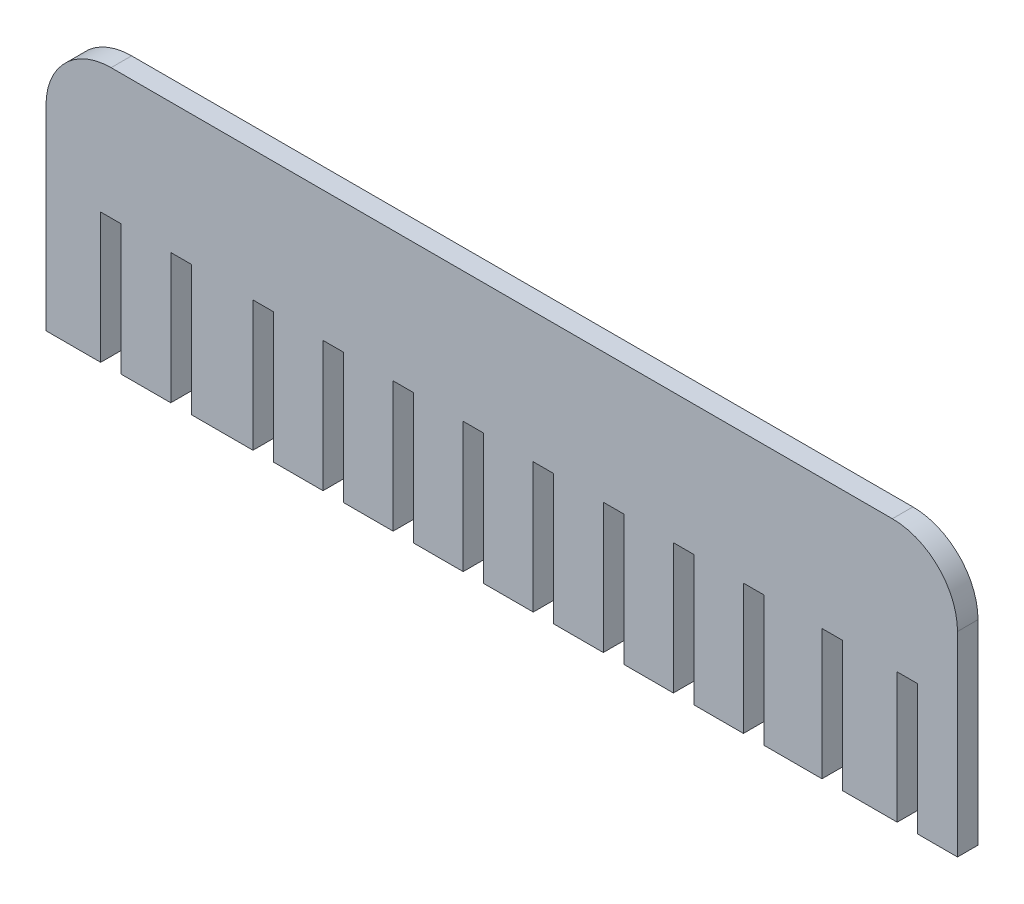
ISO-10303-21;
HEADER;
FILE_DESCRIPTION(('STEP AP214'),'2;1');
FILE_NAME('part.step','',(''),(''),'','','');
FILE_SCHEMA(('AUTOMOTIVE_DESIGN { 1 0 10303 214 1 1 1 1 }'));
ENDSEC;
DATA;
#1=APPLICATION_CONTEXT('core data for automotive mechanical design processes');
#2=APPLICATION_PROTOCOL_DEFINITION('international standard','automotive_design',2000,#1);
#3=PRODUCT_CONTEXT('',#1,'mechanical');
#4=PRODUCT('Part','Part','',(#3));
#5=PRODUCT_RELATED_PRODUCT_CATEGORY('part','',(#4));
#6=PRODUCT_DEFINITION_FORMATION('','',#4);
#7=PRODUCT_DEFINITION_CONTEXT('part definition',#1,'design');
#8=PRODUCT_DEFINITION('design','',#6,#7);
#9=PRODUCT_DEFINITION_SHAPE('','',#8);
#10=(LENGTH_UNIT() NAMED_UNIT(*) SI_UNIT(.MILLI.,.METRE.));
#11=(NAMED_UNIT(*) PLANE_ANGLE_UNIT() SI_UNIT($,.RADIAN.));
#12=(NAMED_UNIT(*) SI_UNIT($,.STERADIAN.) SOLID_ANGLE_UNIT());
#13=UNCERTAINTY_MEASURE_WITH_UNIT(LENGTH_MEASURE(1.E-05),#10,'distance_accuracy_value','');
#14=(GEOMETRIC_REPRESENTATION_CONTEXT(3) GLOBAL_UNCERTAINTY_ASSIGNED_CONTEXT((#13)) GLOBAL_UNIT_ASSIGNED_CONTEXT((#10,
#11,#12)) REPRESENTATION_CONTEXT('',''));
#15=CARTESIAN_POINT('',(0.,0.,0.));
#16=DIRECTION('',(0.,0.,1.));
#17=DIRECTION('',(1.,0.,0.));
#18=AXIS2_PLACEMENT_3D('',#15,#16,#17);
#19=CARTESIAN_POINT('',(51.146000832,38.1,4.000000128));
#20=DIRECTION('',(0.,1.,0.));
#21=DIRECTION('',(0.,0.,1.));
#22=AXIS2_PLACEMENT_3D('',#19,#20,#21);
#23=PLANE('',#22);
#24=DIRECTION('',(1.,0.,0.));
#25=VECTOR('',#24,1.);
#26=CARTESIAN_POINT('',(77.1360001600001,38.1,0.));
#27=LINE('',#26,#25);
#28=CARTESIAN_POINT('',(66.46800016,38.1,0.));
#29=VERTEX_POINT('',#28);
#30=CARTESIAN_POINT('',(77.1360001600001,38.1,0.));
#31=VERTEX_POINT('',#30);
#32=EDGE_CURVE('E391',#29,#31,#27,.T.);
#33=ORIENTED_EDGE('',*,*,#32,.T.);
#34=DIRECTION('',(0.,0.,-1.));
#35=VECTOR('',#34,1.);
#36=CARTESIAN_POINT('',(77.1360001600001,38.1,4.000000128));
#37=LINE('',#36,#35);
#38=CARTESIAN_POINT('',(77.1360001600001,38.1,4.000000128));
#39=VERTEX_POINT('',#38);
#40=EDGE_CURVE('E375',#39,#31,#37,.T.);
#41=ORIENTED_EDGE('',*,*,#40,.F.);
#42=DIRECTION('',(-1.,0.,0.));
#43=VECTOR('',#42,1.);
#44=CARTESIAN_POINT('',(-88.9,38.1,4.000000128));
#45=LINE('',#44,#43);
#46=CARTESIAN_POINT('',(66.4680001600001,38.1,4.000000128));
#47=VERTEX_POINT('',#46);
#48=EDGE_CURVE('E877',#39,#47,#45,.T.);
#49=ORIENTED_EDGE('',*,*,#48,.T.);
#50=DIRECTION('',(0.,0.,1.));
#51=VECTOR('',#50,1.);
#52=CARTESIAN_POINT('',(66.46800016,38.1,4.000000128));
#53=LINE('',#52,#51);
#54=EDGE_CURVE('E398',#29,#47,#53,.T.);
#55=ORIENTED_EDGE('',*,*,#54,.F.);
#56=EDGE_LOOP('',(#33,#41,#49,#55));
#57=FACE_BOUND('',#56,.T.);
#58=ADVANCED_FACE('F35',(#57),#23,.F.);
#59=CARTESIAN_POINT('',(51.146000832,38.1,0.));
#60=VERTEX_POINT('',#59);
#61=CARTESIAN_POINT('',(62.468000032,38.1,0.));
#62=VERTEX_POINT('',#61);
#63=EDGE_CURVE('E400',#60,#62,#27,.T.);
#64=ORIENTED_EDGE('',*,*,#63,.T.);
#65=DIRECTION('',(0.,0.,-1.));
#66=VECTOR('',#65,1.);
#67=CARTESIAN_POINT('',(62.468000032,38.1,4.000000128));
#68=LINE('',#67,#66);
#69=CARTESIAN_POINT('',(62.468000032,38.1,4.000000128));
#70=VERTEX_POINT('',#69);
#71=EDGE_CURVE('E385',#70,#62,#68,.T.);
#72=ORIENTED_EDGE('',*,*,#71,.F.);
#73=DIRECTION('',(1.,0.,0.));
#74=VECTOR('',#73,1.);
#75=CARTESIAN_POINT('',(51.146000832,38.1,4.000000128));
#76=LINE('',#75,#74);
#77=CARTESIAN_POINT('',(51.146000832,38.1,4.000000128));
#78=VERTEX_POINT('',#77);
#79=EDGE_CURVE('E638',#78,#70,#76,.T.);
#80=ORIENTED_EDGE('',*,*,#79,.F.);
#81=DIRECTION('',(0.,0.,-1.));
#82=VECTOR('',#81,1.);
#83=CARTESIAN_POINT('',(51.146000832,38.1,4.000000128));
#84=LINE('',#83,#82);
#85=EDGE_CURVE('E414',#78,#60,#84,.T.);
#86=ORIENTED_EDGE('',*,*,#85,.T.);
#87=EDGE_LOOP('',(#64,#72,#80,#86));
#88=FACE_BOUND('',#87,.T.);
#89=ADVANCED_FACE('F636',(#88),#23,.F.);
#90=CARTESIAN_POINT('',(0.,0.,4.000000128));
#91=DIRECTION('',(0.,0.,-1.));
#92=DIRECTION('',(-1.,0.,0.));
#93=AXIS2_PLACEMENT_3D('',#90,#91,#92);
#94=PLANE('',#93);
#95=DIRECTION('',(0.,-1.,0.));
#96=VECTOR('',#95,1.);
#97=CARTESIAN_POINT('',(-88.9,-88.9,4.000000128));
#98=LINE('',#97,#96);
#99=CARTESIAN_POINT('',(-88.9,76.2,4.000000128));
#100=VERTEX_POINT('',#99);
#101=CARTESIAN_POINT('',(-88.9,38.1,4.000000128));
#102=VERTEX_POINT('',#101);
#103=EDGE_CURVE('E413',#100,#102,#98,.T.);
#104=ORIENTED_EDGE('',*,*,#103,.T.);
#105=CARTESIAN_POINT('',(-78.232,38.1,4.000000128));
#106=VERTEX_POINT('',#105);
#107=EDGE_CURVE('E873',#106,#102,#45,.T.);
#108=ORIENTED_EDGE('',*,*,#107,.F.);
#109=DIRECTION('',(0.,1.,0.));
#110=VECTOR('',#109,1.);
#111=CARTESIAN_POINT('',(-78.232,-88.9,4.000000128));
#112=LINE('',#111,#110);
#113=CARTESIAN_POINT('',(-78.232,63.5,4.000000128));
#114=VERTEX_POINT('',#113);
#115=EDGE_CURVE('E732',#106,#114,#112,.T.);
#116=ORIENTED_EDGE('',*,*,#115,.T.);
#117=DIRECTION('',(-1.,0.,0.));
#118=VECTOR('',#117,1.);
#119=CARTESIAN_POINT('',(-78.232,63.5,4.000000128));
#120=LINE('',#119,#118);
#121=CARTESIAN_POINT('',(-74.231999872,63.5,4.000000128));
#122=VERTEX_POINT('',#121);
#123=EDGE_CURVE('E703',#122,#114,#120,.T.);
#124=ORIENTED_EDGE('',*,*,#123,.F.);
#125=DIRECTION('',(0.,-1.,0.));
#126=VECTOR('',#125,1.);
#127=CARTESIAN_POINT('',(-74.231999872,-88.9,4.000000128));
#128=LINE('',#127,#126);
#129=CARTESIAN_POINT('',(-74.231999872,38.1,4.000000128));
#130=VERTEX_POINT('',#129);
#131=EDGE_CURVE('E734',#122,#130,#128,.T.);
#132=ORIENTED_EDGE('',*,*,#131,.T.);
#133=CARTESIAN_POINT('',(-64.563999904,38.1,4.000000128));
#134=VERTEX_POINT('',#133);
#135=EDGE_CURVE('E875',#134,#130,#45,.T.);
#136=ORIENTED_EDGE('',*,*,#135,.F.);
#137=DIRECTION('',(0.,1.,0.));
#138=VECTOR('',#137,1.);
#139=CARTESIAN_POINT('',(-64.563999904,-88.9,4.000000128));
#140=LINE('',#139,#138);
#141=CARTESIAN_POINT('',(-64.563999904,63.5,4.000000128));
#142=VERTEX_POINT('',#141);
#143=EDGE_CURVE('E737',#134,#142,#140,.T.);
#144=ORIENTED_EDGE('',*,*,#143,.T.);
#145=DIRECTION('',(-1.,0.,0.));
#146=VECTOR('',#145,1.);
#147=CARTESIAN_POINT('',(-64.563999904,63.5,4.000000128));
#148=LINE('',#147,#146);
#149=CARTESIAN_POINT('',(-60.563999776,63.5,4.000000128));
#150=VERTEX_POINT('',#149);
#151=EDGE_CURVE('E693',#150,#142,#148,.T.);
#152=ORIENTED_EDGE('',*,*,#151,.F.);
#153=DIRECTION('',(0.,-1.,0.));
#154=VECTOR('',#153,1.);
#155=CARTESIAN_POINT('',(-60.563999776,-88.9,4.000000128));
#156=LINE('',#155,#154);
#157=CARTESIAN_POINT('',(-60.563999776,38.1,4.000000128));
#158=VERTEX_POINT('',#157);
#159=EDGE_CURVE('E739',#150,#158,#156,.T.);
#160=ORIENTED_EDGE('',*,*,#159,.T.);
#161=DIRECTION('',(1.,0.,0.));
#162=VECTOR('',#161,1.);
#163=CARTESIAN_POINT('',(-49.799999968,38.1,4.000000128));
#164=LINE('',#163,#162);
#165=CARTESIAN_POINT('',(-48.529999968,38.1,4.000000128));
#166=VERTEX_POINT('',#165);
#167=EDGE_CURVE('E742',#158,#166,#164,.T.);
#168=ORIENTED_EDGE('',*,*,#167,.T.);
#169=DIRECTION('',(0.,1.,0.));
#170=VECTOR('',#169,1.);
#171=CARTESIAN_POINT('',(-48.529999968,38.1,4.000000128));
#172=LINE('',#171,#170);
#173=CARTESIAN_POINT('',(-48.529999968,63.5,4.000000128));
#174=VERTEX_POINT('',#173);
#175=EDGE_CURVE('E744',#166,#174,#172,.T.);
#176=ORIENTED_EDGE('',*,*,#175,.T.);
#177=DIRECTION('',(1.,0.,0.));
#178=VECTOR('',#177,1.);
#179=CARTESIAN_POINT('',(-48.529999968,63.5,4.000000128));
#180=LINE('',#179,#178);
#181=CARTESIAN_POINT('',(-44.52999984,63.5,4.000000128));
#182=VERTEX_POINT('',#181);
#183=EDGE_CURVE('E746',#174,#182,#180,.T.);
#184=ORIENTED_EDGE('',*,*,#183,.T.);
#185=DIRECTION('',(0.,-1.,0.));
#186=VECTOR('',#185,1.);
#187=CARTESIAN_POINT('',(-44.52999984,38.1,4.000000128));
#188=LINE('',#187,#186);
#189=CARTESIAN_POINT('',(-44.52999984,38.1,4.000000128));
#190=VERTEX_POINT('',#189);
#191=EDGE_CURVE('E748',#182,#190,#188,.T.);
#192=ORIENTED_EDGE('',*,*,#191,.T.);
#193=DIRECTION('',(1.,0.,0.));
#194=VECTOR('',#193,1.);
#195=CARTESIAN_POINT('',(-44.52999984,38.1,4.000000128));
#196=LINE('',#195,#194);
#197=CARTESIAN_POINT('',(-34.861999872,38.1,4.000000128));
#198=VERTEX_POINT('',#197);
#199=EDGE_CURVE('E750',#190,#198,#196,.T.);
#200=ORIENTED_EDGE('',*,*,#199,.T.);
#201=DIRECTION('',(0.,1.,0.));
#202=VECTOR('',#201,1.);
#203=CARTESIAN_POINT('',(-34.861999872,38.1,4.000000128));
#204=LINE('',#203,#202);
#205=CARTESIAN_POINT('',(-34.861999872,63.5,4.000000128));
#206=VERTEX_POINT('',#205);
#207=EDGE_CURVE('E752',#198,#206,#204,.T.);
#208=ORIENTED_EDGE('',*,*,#207,.T.);
#209=DIRECTION('',(1.,0.,0.));
#210=VECTOR('',#209,1.);
#211=CARTESIAN_POINT('',(-34.861999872,63.5,4.000000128));
#212=LINE('',#211,#210);
#213=CARTESIAN_POINT('',(-30.861999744,63.5,4.000000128));
#214=VERTEX_POINT('',#213);
#215=EDGE_CURVE('E754',#206,#214,#212,.T.);
#216=ORIENTED_EDGE('',*,*,#215,.T.);
#217=DIRECTION('',(0.,-1.,0.));
#218=VECTOR('',#217,1.);
#219=CARTESIAN_POINT('',(-30.861999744,38.1,4.000000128));
#220=LINE('',#219,#218);
#221=CARTESIAN_POINT('',(-30.861999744,38.1,4.000000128));
#222=VERTEX_POINT('',#221);
#223=EDGE_CURVE('E756',#214,#222,#220,.T.);
#224=ORIENTED_EDGE('',*,*,#223,.T.);
#225=DIRECTION('',(1.,0.,0.));
#226=VECTOR('',#225,1.);
#227=CARTESIAN_POINT('',(-30.861999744,38.1,4.000000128));
#228=LINE('',#227,#226);
#229=CARTESIAN_POINT('',(-21.193999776,38.1,4.000000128));
#230=VERTEX_POINT('',#229);
#231=EDGE_CURVE('E758',#222,#230,#228,.T.);
#232=ORIENTED_EDGE('',*,*,#231,.T.);
#233=DIRECTION('',(0.,1.,0.));
#234=VECTOR('',#233,1.);
#235=CARTESIAN_POINT('',(-21.193999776,38.1,4.000000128));
#236=LINE('',#235,#234);
#237=CARTESIAN_POINT('',(-21.193999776,63.5,4.000000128));
#238=VERTEX_POINT('',#237);
#239=EDGE_CURVE('E760',#230,#238,#236,.T.);
#240=ORIENTED_EDGE('',*,*,#239,.T.);
#241=DIRECTION('',(1.,0.,0.));
#242=VECTOR('',#241,1.);
#243=CARTESIAN_POINT('',(-21.193999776,63.5,4.000000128));
#244=LINE('',#243,#242);
#245=CARTESIAN_POINT('',(-17.193999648,63.5,4.000000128));
#246=VERTEX_POINT('',#245);
#247=EDGE_CURVE('E762',#238,#246,#244,.T.);
#248=ORIENTED_EDGE('',*,*,#247,.T.);
#249=DIRECTION('',(0.,-1.,0.));
#250=VECTOR('',#249,1.);
#251=CARTESIAN_POINT('',(-17.193999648,38.1,4.000000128));
#252=LINE('',#251,#250);
#253=CARTESIAN_POINT('',(-17.193999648,38.1,4.000000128));
#254=VERTEX_POINT('',#253);
#255=EDGE_CURVE('E764',#246,#254,#252,.T.);
#256=ORIENTED_EDGE('',*,*,#255,.T.);
#257=DIRECTION('',(1.,0.,0.));
#258=VECTOR('',#257,1.);
#259=CARTESIAN_POINT('',(-17.193999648,38.1,4.000000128));
#260=LINE('',#259,#258);
#261=CARTESIAN_POINT('',(-7.52599967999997,38.1,4.000000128));
#262=VERTEX_POINT('',#261);
#263=EDGE_CURVE('E766',#254,#262,#260,.T.);
#264=ORIENTED_EDGE('',*,*,#263,.T.);
#265=DIRECTION('',(0.,1.,0.));
#266=VECTOR('',#265,1.);
#267=CARTESIAN_POINT('',(-7.52599967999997,38.1,4.000000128));
#268=LINE('',#267,#266);
#269=CARTESIAN_POINT('',(-7.52599967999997,63.5,4.000000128));
#270=VERTEX_POINT('',#269);
#271=EDGE_CURVE('E768',#262,#270,#268,.T.);
#272=ORIENTED_EDGE('',*,*,#271,.T.);
#273=DIRECTION('',(1.,0.,0.));
#274=VECTOR('',#273,1.);
#275=CARTESIAN_POINT('',(-7.52599967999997,63.5,4.000000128));
#276=LINE('',#275,#274);
#277=CARTESIAN_POINT('',(-3.52599955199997,63.5,4.000000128));
#278=VERTEX_POINT('',#277);
#279=EDGE_CURVE('E770',#270,#278,#276,.T.);
#280=ORIENTED_EDGE('',*,*,#279,.T.);
#281=DIRECTION('',(0.,-1.,0.));
#282=VECTOR('',#281,1.);
#283=CARTESIAN_POINT('',(-3.52599955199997,38.1,4.000000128));
#284=LINE('',#283,#282);
#285=CARTESIAN_POINT('',(-3.52599955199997,38.1,4.000000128));
#286=VERTEX_POINT('',#285);
#287=EDGE_CURVE('E772',#278,#286,#284,.T.);
#288=ORIENTED_EDGE('',*,*,#287,.T.);
#289=DIRECTION('',(1.,0.,0.));
#290=VECTOR('',#289,1.);
#291=CARTESIAN_POINT('',(-3.52599955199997,38.1,4.000000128));
#292=LINE('',#291,#290);
#293=CARTESIAN_POINT('',(6.14200041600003,38.1,4.000000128));
#294=VERTEX_POINT('',#293);
#295=EDGE_CURVE('E774',#286,#294,#292,.T.);
#296=ORIENTED_EDGE('',*,*,#295,.T.);
#297=DIRECTION('',(0.,1.,0.));
#298=VECTOR('',#297,1.);
#299=CARTESIAN_POINT('',(6.14200041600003,38.1,4.000000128));
#300=LINE('',#299,#298);
#301=CARTESIAN_POINT('',(6.14200041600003,63.5,4.000000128));
#302=VERTEX_POINT('',#301);
#303=EDGE_CURVE('E776',#294,#302,#300,.T.);
#304=ORIENTED_EDGE('',*,*,#303,.T.);
#305=DIRECTION('',(1.,0.,0.));
#306=VECTOR('',#305,1.);
#307=CARTESIAN_POINT('',(6.14200041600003,63.5,4.000000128));
#308=LINE('',#307,#306);
#309=CARTESIAN_POINT('',(10.142000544,63.5,4.000000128));
#310=VERTEX_POINT('',#309);
#311=EDGE_CURVE('E778',#302,#310,#308,.T.);
#312=ORIENTED_EDGE('',*,*,#311,.T.);
#313=DIRECTION('',(0.,-1.,0.));
#314=VECTOR('',#313,1.);
#315=CARTESIAN_POINT('',(10.142000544,38.1,4.000000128));
#316=LINE('',#315,#314);
#317=CARTESIAN_POINT('',(10.142000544,38.1,4.000000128));
#318=VERTEX_POINT('',#317);
#319=EDGE_CURVE('E780',#310,#318,#316,.T.);
#320=ORIENTED_EDGE('',*,*,#319,.T.);
#321=DIRECTION('',(1.,0.,0.));
#322=VECTOR('',#321,1.);
#323=CARTESIAN_POINT('',(10.142000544,38.1,4.000000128));
#324=LINE('',#323,#322);
#325=CARTESIAN_POINT('',(19.810000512,38.1,4.000000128));
#326=VERTEX_POINT('',#325);
#327=EDGE_CURVE('E782',#318,#326,#324,.T.);
#328=ORIENTED_EDGE('',*,*,#327,.T.);
#329=DIRECTION('',(0.,1.,0.));
#330=VECTOR('',#329,1.);
#331=CARTESIAN_POINT('',(19.810000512,38.1,4.000000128));
#332=LINE('',#331,#330);
#333=CARTESIAN_POINT('',(19.810000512,63.5,4.000000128));
#334=VERTEX_POINT('',#333);
#335=EDGE_CURVE('E784',#326,#334,#332,.T.);
#336=ORIENTED_EDGE('',*,*,#335,.T.);
#337=DIRECTION('',(1.,0.,0.));
#338=VECTOR('',#337,1.);
#339=CARTESIAN_POINT('',(19.810000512,63.5,4.000000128));
#340=LINE('',#339,#338);
#341=CARTESIAN_POINT('',(23.81000064,63.5,4.000000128));
#342=VERTEX_POINT('',#341);
#343=EDGE_CURVE('E786',#334,#342,#340,.T.);
#344=ORIENTED_EDGE('',*,*,#343,.T.);
#345=DIRECTION('',(0.,-1.,0.));
#346=VECTOR('',#345,1.);
#347=CARTESIAN_POINT('',(23.81000064,38.1,4.000000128));
#348=LINE('',#347,#346);
#349=CARTESIAN_POINT('',(23.81000064,38.1,4.000000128));
#350=VERTEX_POINT('',#349);
#351=EDGE_CURVE('E788',#342,#350,#348,.T.);
#352=ORIENTED_EDGE('',*,*,#351,.T.);
#353=DIRECTION('',(1.,0.,0.));
#354=VECTOR('',#353,1.);
#355=CARTESIAN_POINT('',(23.81000064,38.1,4.000000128));
#356=LINE('',#355,#354);
#357=CARTESIAN_POINT('',(33.478000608,38.1,4.000000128));
#358=VERTEX_POINT('',#357);
#359=EDGE_CURVE('E790',#350,#358,#356,.T.);
#360=ORIENTED_EDGE('',*,*,#359,.T.);
#361=DIRECTION('',(0.,1.,0.));
#362=VECTOR('',#361,1.);
#363=CARTESIAN_POINT('',(33.478000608,38.1,4.000000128));
#364=LINE('',#363,#362);
#365=CARTESIAN_POINT('',(33.478000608,63.5,4.000000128));
#366=VERTEX_POINT('',#365);
#367=EDGE_CURVE('E792',#358,#366,#364,.T.);
#368=ORIENTED_EDGE('',*,*,#367,.T.);
#369=DIRECTION('',(1.,0.,0.));
#370=VECTOR('',#369,1.);
#371=CARTESIAN_POINT('',(33.478000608,63.5,4.000000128));
#372=LINE('',#371,#370);
#373=CARTESIAN_POINT('',(37.478000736,63.5,4.000000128));
#374=VERTEX_POINT('',#373);
#375=EDGE_CURVE('E794',#366,#374,#372,.T.);
#376=ORIENTED_EDGE('',*,*,#375,.T.);
#377=DIRECTION('',(0.,-1.,0.));
#378=VECTOR('',#377,1.);
#379=CARTESIAN_POINT('',(37.478000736,38.1,4.000000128));
#380=LINE('',#379,#378);
#381=CARTESIAN_POINT('',(37.478000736,38.1,4.000000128));
#382=VERTEX_POINT('',#381);
#383=EDGE_CURVE('E796',#374,#382,#380,.T.);
#384=ORIENTED_EDGE('',*,*,#383,.T.);
#385=DIRECTION('',(1.,0.,0.));
#386=VECTOR('',#385,1.);
#387=CARTESIAN_POINT('',(37.478000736,38.1,4.000000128));
#388=LINE('',#387,#386);
#389=CARTESIAN_POINT('',(47.146000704,38.1,4.000000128));
#390=VERTEX_POINT('',#389);
#391=EDGE_CURVE('E798',#382,#390,#388,.T.);
#392=ORIENTED_EDGE('',*,*,#391,.T.);
#393=DIRECTION('',(0.,1.,0.));
#394=VECTOR('',#393,1.);
#395=CARTESIAN_POINT('',(47.146000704,38.1,4.000000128));
#396=LINE('',#395,#394);
#397=CARTESIAN_POINT('',(47.146000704,63.5,4.000000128));
#398=VERTEX_POINT('',#397);
#399=EDGE_CURVE('E800',#390,#398,#396,.T.);
#400=ORIENTED_EDGE('',*,*,#399,.T.);
#401=DIRECTION('',(1.,0.,0.));
#402=VECTOR('',#401,1.);
#403=CARTESIAN_POINT('',(47.146000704,63.5,4.000000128));
#404=LINE('',#403,#402);
#405=CARTESIAN_POINT('',(51.146000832,63.5,4.000000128));
#406=VERTEX_POINT('',#405);
#407=EDGE_CURVE('E645',#398,#406,#404,.T.);
#408=ORIENTED_EDGE('',*,*,#407,.T.);
#409=DIRECTION('',(0.,-1.,0.));
#410=VECTOR('',#409,1.);
#411=CARTESIAN_POINT('',(51.146000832,38.1,4.000000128));
#412=LINE('',#411,#410);
#413=EDGE_CURVE('E641',#406,#78,#412,.T.);
#414=ORIENTED_EDGE('',*,*,#413,.T.);
#415=ORIENTED_EDGE('',*,*,#79,.T.);
#416=DIRECTION('',(0.,1.,0.));
#417=VECTOR('',#416,1.);
#418=CARTESIAN_POINT('',(62.468000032,-88.9,4.000000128));
#419=LINE('',#418,#417);
#420=CARTESIAN_POINT('',(62.468000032,63.5,4.000000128));
#421=VERTEX_POINT('',#420);
#422=EDGE_CURVE('E640',#70,#421,#419,.T.);
#423=ORIENTED_EDGE('',*,*,#422,.T.);
#424=DIRECTION('',(1.,0.,0.));
#425=VECTOR('',#424,1.);
#426=CARTESIAN_POINT('',(0.,63.5,4.000000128));
#427=LINE('',#426,#425);
#428=CARTESIAN_POINT('',(66.46800016,63.5,4.000000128));
#429=VERTEX_POINT('',#428);
#430=EDGE_CURVE('E715',#421,#429,#427,.T.);
#431=ORIENTED_EDGE('',*,*,#430,.T.);
#432=DIRECTION('',(0.,-1.,0.));
#433=VECTOR('',#432,1.);
#434=CARTESIAN_POINT('',(66.46800016,-88.9,4.000000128));
#435=LINE('',#434,#433);
#436=EDGE_CURVE('E643',#429,#47,#435,.T.);
#437=ORIENTED_EDGE('',*,*,#436,.T.);
#438=ORIENTED_EDGE('',*,*,#48,.F.);
#439=DIRECTION('',(0.,1.,0.));
#440=VECTOR('',#439,1.);
#441=CARTESIAN_POINT('',(77.1360001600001,-88.9,4.000000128));
#442=LINE('',#441,#440);
#443=CARTESIAN_POINT('',(77.1360001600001,63.5,4.000000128));
#444=VERTEX_POINT('',#443);
#445=EDGE_CURVE('E381',#39,#444,#442,.T.);
#446=ORIENTED_EDGE('',*,*,#445,.T.);
#447=DIRECTION('',(1.,0.,0.));
#448=VECTOR('',#447,1.);
#449=CARTESIAN_POINT('',(0.,63.5,4.000000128));
#450=LINE('',#449,#448);
#451=CARTESIAN_POINT('',(81.136000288,63.5,4.000000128));
#452=VERTEX_POINT('',#451);
#453=EDGE_CURVE('E724',#444,#452,#450,.T.);
#454=ORIENTED_EDGE('',*,*,#453,.T.);
#455=DIRECTION('',(0.,-1.,0.));
#456=VECTOR('',#455,1.);
#457=CARTESIAN_POINT('',(81.136000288,-88.8999999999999,4.000000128));
#458=LINE('',#457,#456);
#459=CARTESIAN_POINT('',(81.1360002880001,38.1,4.000000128));
#460=VERTEX_POINT('',#459);
#461=EDGE_CURVE('E652',#452,#460,#458,.T.);
#462=ORIENTED_EDGE('',*,*,#461,.T.);
#463=CARTESIAN_POINT('',(88.9,38.1,4.000000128));
#464=VERTEX_POINT('',#463);
#465=EDGE_CURVE('E656',#464,#460,#45,.T.);
#466=ORIENTED_EDGE('',*,*,#465,.F.);
#467=DIRECTION('',(0.,1.,0.));
#468=VECTOR('',#467,1.);
#469=CARTESIAN_POINT('',(88.9,-88.9,4.000000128));
#470=LINE('',#469,#468);
#471=CARTESIAN_POINT('',(88.9,76.2,4.000000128));
#472=VERTEX_POINT('',#471);
#473=EDGE_CURVE('E540',#464,#472,#470,.T.);
#474=ORIENTED_EDGE('',*,*,#473,.T.);
#475=CARTESIAN_POINT('',(76.2,76.2,4.000000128));
#476=DIRECTION('',(0.,0.,-1.));
#477=DIRECTION('',(-1.,0.,0.));
#478=AXIS2_PLACEMENT_3D('',#475,#476,#477);
#479=CIRCLE('',#478,12.7);
#480=CARTESIAN_POINT('',(76.2,88.9,4.000000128));
#481=VERTEX_POINT('',#480);
#482=EDGE_CURVE('E520',#472,#481,#479,.F.);
#483=ORIENTED_EDGE('',*,*,#482,.T.);
#484=DIRECTION('',(-1.,0.,0.));
#485=VECTOR('',#484,1.);
#486=CARTESIAN_POINT('',(-88.9,88.9,4.000000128));
#487=LINE('',#486,#485);
#488=CARTESIAN_POINT('',(-76.2,88.9,4.000000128));
#489=VERTEX_POINT('',#488);
#490=EDGE_CURVE('E418',#481,#489,#487,.T.);
#491=ORIENTED_EDGE('',*,*,#490,.T.);
#492=CARTESIAN_POINT('',(-76.2,76.2,4.000000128));
#493=DIRECTION('',(0.,0.,-1.));
#494=DIRECTION('',(-1.,0.,0.));
#495=AXIS2_PLACEMENT_3D('',#492,#493,#494);
#496=CIRCLE('',#495,12.7);
#497=EDGE_CURVE('E11',#489,#100,#496,.F.);
#498=ORIENTED_EDGE('',*,*,#497,.T.);
#499=EDGE_LOOP('',(#104,#108,#116,#124,#132,#136,#144,#152,#160,#168,#176,#184,#192,#200,#208,
#216,#224,#232,#240,#248,#256,#264,#272,#280,#288,#296,#304,#312,#320,#328,#336,#344,#352,#360,
#368,#376,#384,#392,#400,#408,#414,#415,#423,#431,#437,#438,#446,#454,#462,#466,#474,#483,#491,#498));
#500=FACE_BOUND('',#499,.T.);
#501=ADVANCED_FACE('F537',(#500),#94,.F.);
#502=CARTESIAN_POINT('',(-88.9,-88.9,4.000000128));
#503=DIRECTION('',(1.,0.,0.));
#504=DIRECTION('',(0.,0.,-1.));
#505=AXIS2_PLACEMENT_3D('',#502,#503,#504);
#506=PLANE('',#505);
#507=DIRECTION('',(0.,-1.,0.));
#508=VECTOR('',#507,1.);
#509=CARTESIAN_POINT('',(-88.9,-88.9,0.));
#510=LINE('',#509,#508);
#511=CARTESIAN_POINT('',(-88.9,76.2,0.));
#512=VERTEX_POINT('',#511);
#513=CARTESIAN_POINT('',(-88.9,38.1,0.));
#514=VERTEX_POINT('',#513);
#515=EDGE_CURVE('E547',#512,#514,#510,.T.);
#516=ORIENTED_EDGE('',*,*,#515,.T.);
#517=DIRECTION('',(0.,0.,1.));
#518=VECTOR('',#517,1.);
#519=CARTESIAN_POINT('',(-88.9,38.1,0.));
#520=LINE('',#519,#518);
#521=EDGE_CURVE('E58',#514,#102,#520,.T.);
#522=ORIENTED_EDGE('',*,*,#521,.T.);
#523=ORIENTED_EDGE('',*,*,#103,.F.);
#524=DIRECTION('',(0.,0.,-1.));
#525=VECTOR('',#524,1.);
#526=CARTESIAN_POINT('',(-88.9,76.2,4.000000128));
#527=LINE('',#526,#525);
#528=EDGE_CURVE('E522',#100,#512,#527,.T.);
#529=ORIENTED_EDGE('',*,*,#528,.T.);
#530=EDGE_LOOP('',(#516,#522,#523,#529));
#531=FACE_BOUND('',#530,.T.);
#532=ADVANCED_FACE('F546',(#531),#506,.F.);
#533=CARTESIAN_POINT('',(-78.232,-88.9,4.000000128));
#534=DIRECTION('',(-1.,0.,0.));
#535=DIRECTION('',(0.,0.,1.));
#536=AXIS2_PLACEMENT_3D('',#533,#534,#535);
#537=PLANE('',#536);
#538=ORIENTED_EDGE('',*,*,#115,.F.);
#539=DIRECTION('',(0.,0.,-1.));
#540=VECTOR('',#539,1.);
#541=CARTESIAN_POINT('',(-78.232,38.1,4.000000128));
#542=LINE('',#541,#540);
#543=CARTESIAN_POINT('',(-78.232,38.1,0.));
#544=VERTEX_POINT('',#543);
#545=EDGE_CURVE('E690',#106,#544,#542,.T.);
#546=ORIENTED_EDGE('',*,*,#545,.T.);
#547=DIRECTION('',(0.,1.,0.));
#548=VECTOR('',#547,1.);
#549=CARTESIAN_POINT('',(-78.232,-88.9,0.));
#550=LINE('',#549,#548);
#551=CARTESIAN_POINT('',(-78.232,63.5,0.));
#552=VERTEX_POINT('',#551);
#553=EDGE_CURVE('E550',#544,#552,#550,.T.);
#554=ORIENTED_EDGE('',*,*,#553,.T.);
#555=DIRECTION('',(0.,0.,1.));
#556=VECTOR('',#555,1.);
#557=CARTESIAN_POINT('',(-78.232,63.5,0.));
#558=LINE('',#557,#556);
#559=EDGE_CURVE('E712',#552,#114,#558,.T.);
#560=ORIENTED_EDGE('',*,*,#559,.T.);
#561=EDGE_LOOP('',(#538,#546,#554,#560));
#562=FACE_BOUND('',#561,.T.);
#563=ADVANCED_FACE('F1116',(#562),#537,.F.);
#564=CARTESIAN_POINT('',(-74.231999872,-88.9,4.000000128));
#565=DIRECTION('',(1.,0.,0.));
#566=DIRECTION('',(0.,0.,-1.));
#567=AXIS2_PLACEMENT_3D('',#564,#565,#566);
#568=PLANE('',#567);
#569=DIRECTION('',(0.,-1.,0.));
#570=VECTOR('',#569,1.);
#571=CARTESIAN_POINT('',(-74.231999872,-88.9,0.));
#572=LINE('',#571,#570);
#573=CARTESIAN_POINT('',(-74.231999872,63.5,0.));
#574=VERTEX_POINT('',#573);
#575=CARTESIAN_POINT('',(-74.231999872,38.1,0.));
#576=VERTEX_POINT('',#575);
#577=EDGE_CURVE('E553',#574,#576,#572,.T.);
#578=ORIENTED_EDGE('',*,*,#577,.T.);
#579=DIRECTION('',(0.,0.,1.));
#580=VECTOR('',#579,1.);
#581=CARTESIAN_POINT('',(-74.231999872,38.1,4.000000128));
#582=LINE('',#581,#580);
#583=EDGE_CURVE('E687',#576,#130,#582,.T.);
#584=ORIENTED_EDGE('',*,*,#583,.T.);
#585=ORIENTED_EDGE('',*,*,#131,.F.);
#586=DIRECTION('',(0.,0.,1.));
#587=VECTOR('',#586,1.);
#588=CARTESIAN_POINT('',(-74.231999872,63.5,0.));
#589=LINE('',#588,#587);
#590=EDGE_CURVE('E709',#574,#122,#589,.T.);
#591=ORIENTED_EDGE('',*,*,#590,.F.);
#592=EDGE_LOOP('',(#578,#584,#585,#591));
#593=FACE_BOUND('',#592,.T.);
#594=ADVANCED_FACE('F893',(#593),#568,.F.);
#595=CARTESIAN_POINT('',(-64.563999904,-88.9,4.000000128));
#596=DIRECTION('',(-1.,0.,0.));
#597=DIRECTION('',(0.,0.,1.));
#598=AXIS2_PLACEMENT_3D('',#595,#596,#597);
#599=PLANE('',#598);
#600=ORIENTED_EDGE('',*,*,#143,.F.);
#601=DIRECTION('',(0.,0.,-1.));
#602=VECTOR('',#601,1.);
#603=CARTESIAN_POINT('',(-64.563999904,38.1,4.000000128));
#604=LINE('',#603,#602);
#605=CARTESIAN_POINT('',(-64.563999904,38.1,0.));
#606=VERTEX_POINT('',#605);
#607=EDGE_CURVE('E684',#134,#606,#604,.T.);
#608=ORIENTED_EDGE('',*,*,#607,.T.);
#609=DIRECTION('',(0.,1.,0.));
#610=VECTOR('',#609,1.);
#611=CARTESIAN_POINT('',(-64.563999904,-88.9,0.));
#612=LINE('',#611,#610);
#613=CARTESIAN_POINT('',(-64.563999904,63.5,0.));
#614=VERTEX_POINT('',#613);
#615=EDGE_CURVE('E561',#606,#614,#612,.T.);
#616=ORIENTED_EDGE('',*,*,#615,.T.);
#617=DIRECTION('',(0.,0.,1.));
#618=VECTOR('',#617,1.);
#619=CARTESIAN_POINT('',(-64.563999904,63.5,0.));
#620=LINE('',#619,#618);
#621=EDGE_CURVE('E700',#614,#142,#620,.T.);
#622=ORIENTED_EDGE('',*,*,#621,.T.);
#623=EDGE_LOOP('',(#600,#608,#616,#622));
#624=FACE_BOUND('',#623,.T.);
#625=ADVANCED_FACE('F900',(#624),#599,.F.);
#626=CARTESIAN_POINT('',(-60.563999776,-88.9,4.000000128));
#627=DIRECTION('',(1.,0.,0.));
#628=DIRECTION('',(0.,0.,-1.));
#629=AXIS2_PLACEMENT_3D('',#626,#627,#628);
#630=PLANE('',#629);
#631=DIRECTION('',(0.,-1.,0.));
#632=VECTOR('',#631,1.);
#633=CARTESIAN_POINT('',(-60.563999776,-88.9,0.));
#634=LINE('',#633,#632);
#635=CARTESIAN_POINT('',(-60.563999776,63.5,0.));
#636=VERTEX_POINT('',#635);
#637=CARTESIAN_POINT('',(-60.563999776,38.1,0.));
#638=VERTEX_POINT('',#637);
#639=EDGE_CURVE('E563',#636,#638,#634,.T.);
#640=ORIENTED_EDGE('',*,*,#639,.T.);
#641=DIRECTION('',(0.,0.,1.));
#642=VECTOR('',#641,1.);
#643=CARTESIAN_POINT('',(-60.563999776,38.1,4.000000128));
#644=LINE('',#643,#642);
#645=EDGE_CURVE('E680',#638,#158,#644,.T.);
#646=ORIENTED_EDGE('',*,*,#645,.T.);
#647=ORIENTED_EDGE('',*,*,#159,.F.);
#648=DIRECTION('',(0.,0.,1.));
#649=VECTOR('',#648,1.);
#650=CARTESIAN_POINT('',(-60.563999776,63.5,0.));
#651=LINE('',#650,#649);
#652=EDGE_CURVE('E697',#636,#150,#651,.T.);
#653=ORIENTED_EDGE('',*,*,#652,.F.);
#654=EDGE_LOOP('',(#640,#646,#647,#653));
#655=FACE_BOUND('',#654,.T.);
#656=ADVANCED_FACE('F906',(#655),#630,.F.);
#657=CARTESIAN_POINT('',(-49.799999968,38.1,4.000000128));
#658=DIRECTION('',(0.,1.,0.));
#659=DIRECTION('',(0.,0.,1.));
#660=AXIS2_PLACEMENT_3D('',#657,#658,#659);
#661=PLANE('',#660);
#662=DIRECTION('',(1.,0.,0.));
#663=VECTOR('',#662,1.);
#664=CARTESIAN_POINT('',(-49.799999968,38.1,0.));
#665=LINE('',#664,#663);
#666=CARTESIAN_POINT('',(-48.529999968,38.1,0.));
#667=VERTEX_POINT('',#666);
#668=EDGE_CURVE('E50',#638,#667,#665,.T.);
#669=ORIENTED_EDGE('',*,*,#668,.T.);
#670=DIRECTION('',(0.,0.,-1.));
#671=VECTOR('',#670,1.);
#672=CARTESIAN_POINT('',(-48.529999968,38.1,4.000000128));
#673=LINE('',#672,#671);
#674=EDGE_CURVE('E508',#166,#667,#673,.T.);
#675=ORIENTED_EDGE('',*,*,#674,.F.);
#676=ORIENTED_EDGE('',*,*,#167,.F.);
#677=ORIENTED_EDGE('',*,*,#645,.F.);
#678=EDGE_LOOP('',(#669,#675,#676,#677));
#679=FACE_BOUND('',#678,.T.);
#680=ADVANCED_FACE('F908',(#679),#661,.F.);
#681=CARTESIAN_POINT('',(-48.529999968,38.1,4.000000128));
#682=DIRECTION('',(-1.,0.,0.));
#683=DIRECTION('',(0.,0.,1.));
#684=AXIS2_PLACEMENT_3D('',#681,#682,#683);
#685=PLANE('',#684);
#686=DIRECTION('',(0.,1.,0.));
#687=VECTOR('',#686,1.);
#688=CARTESIAN_POINT('',(-48.529999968,38.1,0.));
#689=LINE('',#688,#687);
#690=CARTESIAN_POINT('',(-48.529999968,63.5,0.));
#691=VERTEX_POINT('',#690);
#692=EDGE_CURVE('E567',#667,#691,#689,.T.);
#693=ORIENTED_EDGE('',*,*,#692,.T.);
#694=DIRECTION('',(0.,0.,-1.));
#695=VECTOR('',#694,1.);
#696=CARTESIAN_POINT('',(-48.529999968,63.5,4.000000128));
#697=LINE('',#696,#695);
#698=EDGE_CURVE('E505',#174,#691,#697,.T.);
#699=ORIENTED_EDGE('',*,*,#698,.F.);
#700=ORIENTED_EDGE('',*,*,#175,.F.);
#701=ORIENTED_EDGE('',*,*,#674,.T.);
#702=EDGE_LOOP('',(#693,#699,#700,#701));
#703=FACE_BOUND('',#702,.T.);
#704=ADVANCED_FACE('F915',(#703),#685,.F.);
#705=CARTESIAN_POINT('',(-48.529999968,63.5,4.000000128));
#706=DIRECTION('',(0.,1.,0.));
#707=DIRECTION('',(0.,0.,1.));
#708=AXIS2_PLACEMENT_3D('',#705,#706,#707);
#709=PLANE('',#708);
#710=DIRECTION('',(1.,0.,0.));
#711=VECTOR('',#710,1.);
#712=CARTESIAN_POINT('',(-48.529999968,63.5,0.));
#713=LINE('',#712,#711);
#714=CARTESIAN_POINT('',(-44.52999984,63.5,0.));
#715=VERTEX_POINT('',#714);
#716=EDGE_CURVE('E569',#691,#715,#713,.T.);
#717=ORIENTED_EDGE('',*,*,#716,.T.);
#718=DIRECTION('',(0.,0.,-1.));
#719=VECTOR('',#718,1.);
#720=CARTESIAN_POINT('',(-44.52999984,63.5,4.000000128));
#721=LINE('',#720,#719);
#722=EDGE_CURVE('E502',#182,#715,#721,.T.);
#723=ORIENTED_EDGE('',*,*,#722,.F.);
#724=ORIENTED_EDGE('',*,*,#183,.F.);
#725=ORIENTED_EDGE('',*,*,#698,.T.);
#726=EDGE_LOOP('',(#717,#723,#724,#725));
#727=FACE_BOUND('',#726,.T.);
#728=ADVANCED_FACE('F918',(#727),#709,.F.);
#729=CARTESIAN_POINT('',(-44.52999984,38.1,4.000000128));
#730=DIRECTION('',(1.,0.,0.));
#731=DIRECTION('',(0.,0.,-1.));
#732=AXIS2_PLACEMENT_3D('',#729,#730,#731);
#733=PLANE('',#732);
#734=DIRECTION('',(0.,-1.,0.));
#735=VECTOR('',#734,1.);
#736=CARTESIAN_POINT('',(-44.52999984,38.1,0.));
#737=LINE('',#736,#735);
#738=CARTESIAN_POINT('',(-44.52999984,38.1,0.));
#739=VERTEX_POINT('',#738);
#740=EDGE_CURVE('E571',#715,#739,#737,.T.);
#741=ORIENTED_EDGE('',*,*,#740,.T.);
#742=DIRECTION('',(0.,0.,-1.));
#743=VECTOR('',#742,1.);
#744=CARTESIAN_POINT('',(-44.52999984,38.1,4.000000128));
#745=LINE('',#744,#743);
#746=EDGE_CURVE('E499',#190,#739,#745,.T.);
#747=ORIENTED_EDGE('',*,*,#746,.F.);
#748=ORIENTED_EDGE('',*,*,#191,.F.);
#749=ORIENTED_EDGE('',*,*,#722,.T.);
#750=EDGE_LOOP('',(#741,#747,#748,#749));
#751=FACE_BOUND('',#750,.T.);
#752=ADVANCED_FACE('F923',(#751),#733,.F.);
#753=CARTESIAN_POINT('',(-44.52999984,38.1,4.000000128));
#754=DIRECTION('',(0.,1.,0.));
#755=DIRECTION('',(0.,0.,1.));
#756=AXIS2_PLACEMENT_3D('',#753,#754,#755);
#757=PLANE('',#756);
#758=DIRECTION('',(1.,0.,0.));
#759=VECTOR('',#758,1.);
#760=CARTESIAN_POINT('',(-44.52999984,38.1,0.));
#761=LINE('',#760,#759);
#762=CARTESIAN_POINT('',(-34.861999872,38.1,0.));
#763=VERTEX_POINT('',#762);
#764=EDGE_CURVE('E573',#739,#763,#761,.T.);
#765=ORIENTED_EDGE('',*,*,#764,.T.);
#766=DIRECTION('',(0.,0.,-1.));
#767=VECTOR('',#766,1.);
#768=CARTESIAN_POINT('',(-34.861999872,38.1,4.000000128));
#769=LINE('',#768,#767);
#770=EDGE_CURVE('E496',#198,#763,#769,.T.);
#771=ORIENTED_EDGE('',*,*,#770,.F.);
#772=ORIENTED_EDGE('',*,*,#199,.F.);
#773=ORIENTED_EDGE('',*,*,#746,.T.);
#774=EDGE_LOOP('',(#765,#771,#772,#773));
#775=FACE_BOUND('',#774,.T.);
#776=ADVANCED_FACE('F929',(#775),#757,.F.);
#777=CARTESIAN_POINT('',(-34.861999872,38.1,4.000000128));
#778=DIRECTION('',(-1.,0.,0.));
#779=DIRECTION('',(0.,0.,1.));
#780=AXIS2_PLACEMENT_3D('',#777,#778,#779);
#781=PLANE('',#780);
#782=DIRECTION('',(0.,1.,0.));
#783=VECTOR('',#782,1.);
#784=CARTESIAN_POINT('',(-34.861999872,38.1,0.));
#785=LINE('',#784,#783);
#786=CARTESIAN_POINT('',(-34.861999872,63.5,0.));
#787=VERTEX_POINT('',#786);
#788=EDGE_CURVE('E575',#763,#787,#785,.T.);
#789=ORIENTED_EDGE('',*,*,#788,.T.);
#790=DIRECTION('',(0.,0.,-1.));
#791=VECTOR('',#790,1.);
#792=CARTESIAN_POINT('',(-34.861999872,63.5,4.000000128));
#793=LINE('',#792,#791);
#794=EDGE_CURVE('E493',#206,#787,#793,.T.);
#795=ORIENTED_EDGE('',*,*,#794,.F.);
#796=ORIENTED_EDGE('',*,*,#207,.F.);
#797=ORIENTED_EDGE('',*,*,#770,.T.);
#798=EDGE_LOOP('',(#789,#795,#796,#797));
#799=FACE_BOUND('',#798,.T.);
#800=ADVANCED_FACE('F933',(#799),#781,.F.);
#801=CARTESIAN_POINT('',(-34.861999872,63.5,4.000000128));
#802=DIRECTION('',(0.,1.,0.));
#803=DIRECTION('',(0.,0.,1.));
#804=AXIS2_PLACEMENT_3D('',#801,#802,#803);
#805=PLANE('',#804);
#806=DIRECTION('',(1.,0.,0.));
#807=VECTOR('',#806,1.);
#808=CARTESIAN_POINT('',(-34.861999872,63.5,0.));
#809=LINE('',#808,#807);
#810=CARTESIAN_POINT('',(-30.861999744,63.5,0.));
#811=VERTEX_POINT('',#810);
#812=EDGE_CURVE('E577',#787,#811,#809,.T.);
#813=ORIENTED_EDGE('',*,*,#812,.T.);
#814=DIRECTION('',(0.,0.,-1.));
#815=VECTOR('',#814,1.);
#816=CARTESIAN_POINT('',(-30.861999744,63.5,4.000000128));
#817=LINE('',#816,#815);
#818=EDGE_CURVE('E490',#214,#811,#817,.T.);
#819=ORIENTED_EDGE('',*,*,#818,.F.);
#820=ORIENTED_EDGE('',*,*,#215,.F.);
#821=ORIENTED_EDGE('',*,*,#794,.T.);
#822=EDGE_LOOP('',(#813,#819,#820,#821));
#823=FACE_BOUND('',#822,.T.);
#824=ADVANCED_FACE('F938',(#823),#805,.F.);
#825=CARTESIAN_POINT('',(-30.861999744,38.1,4.000000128));
#826=DIRECTION('',(1.,0.,0.));
#827=DIRECTION('',(0.,0.,-1.));
#828=AXIS2_PLACEMENT_3D('',#825,#826,#827);
#829=PLANE('',#828);
#830=DIRECTION('',(0.,-1.,0.));
#831=VECTOR('',#830,1.);
#832=CARTESIAN_POINT('',(-30.861999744,38.1,0.));
#833=LINE('',#832,#831);
#834=CARTESIAN_POINT('',(-30.861999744,38.1,0.));
#835=VERTEX_POINT('',#834);
#836=EDGE_CURVE('E579',#811,#835,#833,.T.);
#837=ORIENTED_EDGE('',*,*,#836,.T.);
#838=DIRECTION('',(0.,0.,-1.));
#839=VECTOR('',#838,1.);
#840=CARTESIAN_POINT('',(-30.861999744,38.1,4.000000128));
#841=LINE('',#840,#839);
#842=EDGE_CURVE('E487',#222,#835,#841,.T.);
#843=ORIENTED_EDGE('',*,*,#842,.F.);
#844=ORIENTED_EDGE('',*,*,#223,.F.);
#845=ORIENTED_EDGE('',*,*,#818,.T.);
#846=EDGE_LOOP('',(#837,#843,#844,#845));
#847=FACE_BOUND('',#846,.T.);
#848=ADVANCED_FACE('F944',(#847),#829,.F.);
#849=CARTESIAN_POINT('',(-30.861999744,38.1,4.000000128));
#850=DIRECTION('',(0.,1.,0.));
#851=DIRECTION('',(0.,0.,1.));
#852=AXIS2_PLACEMENT_3D('',#849,#850,#851);
#853=PLANE('',#852);
#854=DIRECTION('',(1.,0.,0.));
#855=VECTOR('',#854,1.);
#856=CARTESIAN_POINT('',(-30.861999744,38.1,0.));
#857=LINE('',#856,#855);
#858=CARTESIAN_POINT('',(-21.193999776,38.1,0.));
#859=VERTEX_POINT('',#858);
#860=EDGE_CURVE('E581',#835,#859,#857,.T.);
#861=ORIENTED_EDGE('',*,*,#860,.T.);
#862=DIRECTION('',(0.,0.,-1.));
#863=VECTOR('',#862,1.);
#864=CARTESIAN_POINT('',(-21.193999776,38.1,4.000000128));
#865=LINE('',#864,#863);
#866=EDGE_CURVE('E484',#230,#859,#865,.T.);
#867=ORIENTED_EDGE('',*,*,#866,.F.);
#868=ORIENTED_EDGE('',*,*,#231,.F.);
#869=ORIENTED_EDGE('',*,*,#842,.T.);
#870=EDGE_LOOP('',(#861,#867,#868,#869));
#871=FACE_BOUND('',#870,.T.);
#872=ADVANCED_FACE('F948',(#871),#853,.F.);
#873=CARTESIAN_POINT('',(-21.193999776,38.1,4.000000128));
#874=DIRECTION('',(-1.,0.,0.));
#875=DIRECTION('',(0.,0.,1.));
#876=AXIS2_PLACEMENT_3D('',#873,#874,#875);
#877=PLANE('',#876);
#878=DIRECTION('',(0.,1.,0.));
#879=VECTOR('',#878,1.);
#880=CARTESIAN_POINT('',(-21.193999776,38.1,0.));
#881=LINE('',#880,#879);
#882=CARTESIAN_POINT('',(-21.193999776,63.5,0.));
#883=VERTEX_POINT('',#882);
#884=EDGE_CURVE('E583',#859,#883,#881,.T.);
#885=ORIENTED_EDGE('',*,*,#884,.T.);
#886=DIRECTION('',(0.,0.,-1.));
#887=VECTOR('',#886,1.);
#888=CARTESIAN_POINT('',(-21.193999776,63.5,4.000000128));
#889=LINE('',#888,#887);
#890=EDGE_CURVE('E481',#238,#883,#889,.T.);
#891=ORIENTED_EDGE('',*,*,#890,.F.);
#892=ORIENTED_EDGE('',*,*,#239,.F.);
#893=ORIENTED_EDGE('',*,*,#866,.T.);
#894=EDGE_LOOP('',(#885,#891,#892,#893));
#895=FACE_BOUND('',#894,.T.);
#896=ADVANCED_FACE('F953',(#895),#877,.F.);
#897=CARTESIAN_POINT('',(-21.193999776,63.5,4.000000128));
#898=DIRECTION('',(0.,1.,0.));
#899=DIRECTION('',(0.,0.,1.));
#900=AXIS2_PLACEMENT_3D('',#897,#898,#899);
#901=PLANE('',#900);
#902=DIRECTION('',(1.,0.,0.));
#903=VECTOR('',#902,1.);
#904=CARTESIAN_POINT('',(-21.193999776,63.5,0.));
#905=LINE('',#904,#903);
#906=CARTESIAN_POINT('',(-17.193999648,63.5,0.));
#907=VERTEX_POINT('',#906);
#908=EDGE_CURVE('E585',#883,#907,#905,.T.);
#909=ORIENTED_EDGE('',*,*,#908,.T.);
#910=DIRECTION('',(0.,0.,-1.));
#911=VECTOR('',#910,1.);
#912=CARTESIAN_POINT('',(-17.193999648,63.5,4.000000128));
#913=LINE('',#912,#911);
#914=EDGE_CURVE('E478',#246,#907,#913,.T.);
#915=ORIENTED_EDGE('',*,*,#914,.F.);
#916=ORIENTED_EDGE('',*,*,#247,.F.);
#917=ORIENTED_EDGE('',*,*,#890,.T.);
#918=EDGE_LOOP('',(#909,#915,#916,#917));
#919=FACE_BOUND('',#918,.T.);
#920=ADVANCED_FACE('F959',(#919),#901,.F.);
#921=CARTESIAN_POINT('',(-17.193999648,38.1,4.000000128));
#922=DIRECTION('',(1.,0.,0.));
#923=DIRECTION('',(0.,0.,-1.));
#924=AXIS2_PLACEMENT_3D('',#921,#922,#923);
#925=PLANE('',#924);
#926=DIRECTION('',(0.,-1.,0.));
#927=VECTOR('',#926,1.);
#928=CARTESIAN_POINT('',(-17.193999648,38.1,0.));
#929=LINE('',#928,#927);
#930=CARTESIAN_POINT('',(-17.193999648,38.1,0.));
#931=VERTEX_POINT('',#930);
#932=EDGE_CURVE('E587',#907,#931,#929,.T.);
#933=ORIENTED_EDGE('',*,*,#932,.T.);
#934=DIRECTION('',(0.,0.,-1.));
#935=VECTOR('',#934,1.);
#936=CARTESIAN_POINT('',(-17.193999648,38.1,4.000000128));
#937=LINE('',#936,#935);
#938=EDGE_CURVE('E475',#254,#931,#937,.T.);
#939=ORIENTED_EDGE('',*,*,#938,.F.);
#940=ORIENTED_EDGE('',*,*,#255,.F.);
#941=ORIENTED_EDGE('',*,*,#914,.T.);
#942=EDGE_LOOP('',(#933,#939,#940,#941));
#943=FACE_BOUND('',#942,.T.);
#944=ADVANCED_FACE('F963',(#943),#925,.F.);
#945=CARTESIAN_POINT('',(-17.193999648,38.1,4.000000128));
#946=DIRECTION('',(0.,1.,0.));
#947=DIRECTION('',(0.,0.,1.));
#948=AXIS2_PLACEMENT_3D('',#945,#946,#947);
#949=PLANE('',#948);
#950=DIRECTION('',(1.,0.,0.));
#951=VECTOR('',#950,1.);
#952=CARTESIAN_POINT('',(-17.193999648,38.1,0.));
#953=LINE('',#952,#951);
#954=CARTESIAN_POINT('',(-7.52599967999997,38.1,0.));
#955=VERTEX_POINT('',#954);
#956=EDGE_CURVE('E589',#931,#955,#953,.T.);
#957=ORIENTED_EDGE('',*,*,#956,.T.);
#958=DIRECTION('',(0.,0.,-1.));
#959=VECTOR('',#958,1.);
#960=CARTESIAN_POINT('',(-7.52599967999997,38.1,4.000000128));
#961=LINE('',#960,#959);
#962=EDGE_CURVE('E472',#262,#955,#961,.T.);
#963=ORIENTED_EDGE('',*,*,#962,.F.);
#964=ORIENTED_EDGE('',*,*,#263,.F.);
#965=ORIENTED_EDGE('',*,*,#938,.T.);
#966=EDGE_LOOP('',(#957,#963,#964,#965));
#967=FACE_BOUND('',#966,.T.);
#968=ADVANCED_FACE('F968',(#967),#949,.F.);
#969=CARTESIAN_POINT('',(-7.52599967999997,38.1,4.000000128));
#970=DIRECTION('',(-1.,0.,0.));
#971=DIRECTION('',(0.,0.,1.));
#972=AXIS2_PLACEMENT_3D('',#969,#970,#971);
#973=PLANE('',#972);
#974=DIRECTION('',(0.,1.,0.));
#975=VECTOR('',#974,1.);
#976=CARTESIAN_POINT('',(-7.52599967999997,38.1,0.));
#977=LINE('',#976,#975);
#978=CARTESIAN_POINT('',(-7.52599967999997,63.5,0.));
#979=VERTEX_POINT('',#978);
#980=EDGE_CURVE('E591',#955,#979,#977,.T.);
#981=ORIENTED_EDGE('',*,*,#980,.T.);
#982=DIRECTION('',(0.,0.,-1.));
#983=VECTOR('',#982,1.);
#984=CARTESIAN_POINT('',(-7.52599967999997,63.5,4.000000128));
#985=LINE('',#984,#983);
#986=EDGE_CURVE('E469',#270,#979,#985,.T.);
#987=ORIENTED_EDGE('',*,*,#986,.F.);
#988=ORIENTED_EDGE('',*,*,#271,.F.);
#989=ORIENTED_EDGE('',*,*,#962,.T.);
#990=EDGE_LOOP('',(#981,#987,#988,#989));
#991=FACE_BOUND('',#990,.T.);
#992=ADVANCED_FACE('F974',(#991),#973,.F.);
#993=CARTESIAN_POINT('',(-7.52599967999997,63.5,4.000000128));
#994=DIRECTION('',(0.,1.,0.));
#995=DIRECTION('',(0.,0.,1.));
#996=AXIS2_PLACEMENT_3D('',#993,#994,#995);
#997=PLANE('',#996);
#998=DIRECTION('',(1.,0.,0.));
#999=VECTOR('',#998,1.);
#1000=CARTESIAN_POINT('',(-7.52599967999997,63.5,0.));
#1001=LINE('',#1000,#999);
#1002=CARTESIAN_POINT('',(-3.52599955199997,63.5,0.));
#1003=VERTEX_POINT('',#1002);
#1004=EDGE_CURVE('E593',#979,#1003,#1001,.T.);
#1005=ORIENTED_EDGE('',*,*,#1004,.T.);
#1006=DIRECTION('',(0.,0.,-1.));
#1007=VECTOR('',#1006,1.);
#1008=CARTESIAN_POINT('',(-3.52599955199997,63.5,4.000000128));
#1009=LINE('',#1008,#1007);
#1010=EDGE_CURVE('E466',#278,#1003,#1009,.T.);
#1011=ORIENTED_EDGE('',*,*,#1010,.F.);
#1012=ORIENTED_EDGE('',*,*,#279,.F.);
#1013=ORIENTED_EDGE('',*,*,#986,.T.);
#1014=EDGE_LOOP('',(#1005,#1011,#1012,#1013));
#1015=FACE_BOUND('',#1014,.T.);
#1016=ADVANCED_FACE('F978',(#1015),#997,.F.);
#1017=CARTESIAN_POINT('',(-3.52599955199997,38.1,4.000000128));
#1018=DIRECTION('',(1.,0.,0.));
#1019=DIRECTION('',(0.,0.,-1.));
#1020=AXIS2_PLACEMENT_3D('',#1017,#1018,#1019);
#1021=PLANE('',#1020);
#1022=DIRECTION('',(0.,-1.,0.));
#1023=VECTOR('',#1022,1.);
#1024=CARTESIAN_POINT('',(-3.52599955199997,38.1,0.));
#1025=LINE('',#1024,#1023);
#1026=CARTESIAN_POINT('',(-3.52599955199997,38.1,0.));
#1027=VERTEX_POINT('',#1026);
#1028=EDGE_CURVE('E595',#1003,#1027,#1025,.T.);
#1029=ORIENTED_EDGE('',*,*,#1028,.T.);
#1030=DIRECTION('',(0.,0.,-1.));
#1031=VECTOR('',#1030,1.);
#1032=CARTESIAN_POINT('',(-3.52599955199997,38.1,4.000000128));
#1033=LINE('',#1032,#1031);
#1034=EDGE_CURVE('E463',#286,#1027,#1033,.T.);
#1035=ORIENTED_EDGE('',*,*,#1034,.F.);
#1036=ORIENTED_EDGE('',*,*,#287,.F.);
#1037=ORIENTED_EDGE('',*,*,#1010,.T.);
#1038=EDGE_LOOP('',(#1029,#1035,#1036,#1037));
#1039=FACE_BOUND('',#1038,.T.);
#1040=ADVANCED_FACE('F983',(#1039),#1021,.F.);
#1041=CARTESIAN_POINT('',(-3.52599955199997,38.1,4.000000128));
#1042=DIRECTION('',(0.,1.,0.));
#1043=DIRECTION('',(0.,0.,1.));
#1044=AXIS2_PLACEMENT_3D('',#1041,#1042,#1043);
#1045=PLANE('',#1044);
#1046=DIRECTION('',(1.,0.,0.));
#1047=VECTOR('',#1046,1.);
#1048=CARTESIAN_POINT('',(-3.52599955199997,38.1,0.));
#1049=LINE('',#1048,#1047);
#1050=CARTESIAN_POINT('',(6.14200041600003,38.1,0.));
#1051=VERTEX_POINT('',#1050);
#1052=EDGE_CURVE('E597',#1027,#1051,#1049,.T.);
#1053=ORIENTED_EDGE('',*,*,#1052,.T.);
#1054=DIRECTION('',(0.,0.,-1.));
#1055=VECTOR('',#1054,1.);
#1056=CARTESIAN_POINT('',(6.14200041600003,38.1,4.000000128));
#1057=LINE('',#1056,#1055);
#1058=EDGE_CURVE('E460',#294,#1051,#1057,.T.);
#1059=ORIENTED_EDGE('',*,*,#1058,.F.);
#1060=ORIENTED_EDGE('',*,*,#295,.F.);
#1061=ORIENTED_EDGE('',*,*,#1034,.T.);
#1062=EDGE_LOOP('',(#1053,#1059,#1060,#1061));
#1063=FACE_BOUND('',#1062,.T.);
#1064=ADVANCED_FACE('F989',(#1063),#1045,.F.);
#1065=CARTESIAN_POINT('',(6.14200041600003,38.1,4.000000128));
#1066=DIRECTION('',(-1.,0.,0.));
#1067=DIRECTION('',(0.,0.,1.));
#1068=AXIS2_PLACEMENT_3D('',#1065,#1066,#1067);
#1069=PLANE('',#1068);
#1070=DIRECTION('',(0.,1.,0.));
#1071=VECTOR('',#1070,1.);
#1072=CARTESIAN_POINT('',(6.14200041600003,38.1,0.));
#1073=LINE('',#1072,#1071);
#1074=CARTESIAN_POINT('',(6.14200041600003,63.5,0.));
#1075=VERTEX_POINT('',#1074);
#1076=EDGE_CURVE('E599',#1051,#1075,#1073,.T.);
#1077=ORIENTED_EDGE('',*,*,#1076,.T.);
#1078=DIRECTION('',(0.,0.,-1.));
#1079=VECTOR('',#1078,1.);
#1080=CARTESIAN_POINT('',(6.14200041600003,63.5,4.000000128));
#1081=LINE('',#1080,#1079);
#1082=EDGE_CURVE('E457',#302,#1075,#1081,.T.);
#1083=ORIENTED_EDGE('',*,*,#1082,.F.);
#1084=ORIENTED_EDGE('',*,*,#303,.F.);
#1085=ORIENTED_EDGE('',*,*,#1058,.T.);
#1086=EDGE_LOOP('',(#1077,#1083,#1084,#1085));
#1087=FACE_BOUND('',#1086,.T.);
#1088=ADVANCED_FACE('F993',(#1087),#1069,.F.);
#1089=CARTESIAN_POINT('',(6.14200041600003,63.5,4.000000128));
#1090=DIRECTION('',(0.,1.,0.));
#1091=DIRECTION('',(0.,0.,1.));
#1092=AXIS2_PLACEMENT_3D('',#1089,#1090,#1091);
#1093=PLANE('',#1092);
#1094=DIRECTION('',(1.,0.,0.));
#1095=VECTOR('',#1094,1.);
#1096=CARTESIAN_POINT('',(6.14200041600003,63.5,0.));
#1097=LINE('',#1096,#1095);
#1098=CARTESIAN_POINT('',(10.142000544,63.5,0.));
#1099=VERTEX_POINT('',#1098);
#1100=EDGE_CURVE('E601',#1075,#1099,#1097,.T.);
#1101=ORIENTED_EDGE('',*,*,#1100,.T.);
#1102=DIRECTION('',(0.,0.,-1.));
#1103=VECTOR('',#1102,1.);
#1104=CARTESIAN_POINT('',(10.142000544,63.5,4.000000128));
#1105=LINE('',#1104,#1103);
#1106=EDGE_CURVE('E454',#310,#1099,#1105,.T.);
#1107=ORIENTED_EDGE('',*,*,#1106,.F.);
#1108=ORIENTED_EDGE('',*,*,#311,.F.);
#1109=ORIENTED_EDGE('',*,*,#1082,.T.);
#1110=EDGE_LOOP('',(#1101,#1107,#1108,#1109));
#1111=FACE_BOUND('',#1110,.T.);
#1112=ADVANCED_FACE('F998',(#1111),#1093,.F.);
#1113=CARTESIAN_POINT('',(10.142000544,38.1,4.000000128));
#1114=DIRECTION('',(1.,0.,0.));
#1115=DIRECTION('',(0.,0.,-1.));
#1116=AXIS2_PLACEMENT_3D('',#1113,#1114,#1115);
#1117=PLANE('',#1116);
#1118=DIRECTION('',(0.,-1.,0.));
#1119=VECTOR('',#1118,1.);
#1120=CARTESIAN_POINT('',(10.142000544,38.1,0.));
#1121=LINE('',#1120,#1119);
#1122=CARTESIAN_POINT('',(10.142000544,38.1,0.));
#1123=VERTEX_POINT('',#1122);
#1124=EDGE_CURVE('E603',#1099,#1123,#1121,.T.);
#1125=ORIENTED_EDGE('',*,*,#1124,.T.);
#1126=DIRECTION('',(0.,0.,-1.));
#1127=VECTOR('',#1126,1.);
#1128=CARTESIAN_POINT('',(10.142000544,38.1,4.000000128));
#1129=LINE('',#1128,#1127);
#1130=EDGE_CURVE('E451',#318,#1123,#1129,.T.);
#1131=ORIENTED_EDGE('',*,*,#1130,.F.);
#1132=ORIENTED_EDGE('',*,*,#319,.F.);
#1133=ORIENTED_EDGE('',*,*,#1106,.T.);
#1134=EDGE_LOOP('',(#1125,#1131,#1132,#1133));
#1135=FACE_BOUND('',#1134,.T.);
#1136=ADVANCED_FACE('F1004',(#1135),#1117,.F.);
#1137=CARTESIAN_POINT('',(10.142000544,38.1,4.000000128));
#1138=DIRECTION('',(0.,1.,0.));
#1139=DIRECTION('',(0.,0.,1.));
#1140=AXIS2_PLACEMENT_3D('',#1137,#1138,#1139);
#1141=PLANE('',#1140);
#1142=DIRECTION('',(1.,0.,0.));
#1143=VECTOR('',#1142,1.);
#1144=CARTESIAN_POINT('',(10.142000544,38.1,0.));
#1145=LINE('',#1144,#1143);
#1146=CARTESIAN_POINT('',(19.810000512,38.1,0.));
#1147=VERTEX_POINT('',#1146);
#1148=EDGE_CURVE('E605',#1123,#1147,#1145,.T.);
#1149=ORIENTED_EDGE('',*,*,#1148,.T.);
#1150=DIRECTION('',(0.,0.,-1.));
#1151=VECTOR('',#1150,1.);
#1152=CARTESIAN_POINT('',(19.810000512,38.1,4.000000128));
#1153=LINE('',#1152,#1151);
#1154=EDGE_CURVE('E448',#326,#1147,#1153,.T.);
#1155=ORIENTED_EDGE('',*,*,#1154,.F.);
#1156=ORIENTED_EDGE('',*,*,#327,.F.);
#1157=ORIENTED_EDGE('',*,*,#1130,.T.);
#1158=EDGE_LOOP('',(#1149,#1155,#1156,#1157));
#1159=FACE_BOUND('',#1158,.T.);
#1160=ADVANCED_FACE('F1008',(#1159),#1141,.F.);
#1161=CARTESIAN_POINT('',(19.810000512,38.1,4.000000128));
#1162=DIRECTION('',(-1.,0.,0.));
#1163=DIRECTION('',(0.,0.,1.));
#1164=AXIS2_PLACEMENT_3D('',#1161,#1162,#1163);
#1165=PLANE('',#1164);
#1166=DIRECTION('',(0.,1.,0.));
#1167=VECTOR('',#1166,1.);
#1168=CARTESIAN_POINT('',(19.810000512,38.1,0.));
#1169=LINE('',#1168,#1167);
#1170=CARTESIAN_POINT('',(19.810000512,63.5,0.));
#1171=VERTEX_POINT('',#1170);
#1172=EDGE_CURVE('E607',#1147,#1171,#1169,.T.);
#1173=ORIENTED_EDGE('',*,*,#1172,.T.);
#1174=DIRECTION('',(0.,0.,-1.));
#1175=VECTOR('',#1174,1.);
#1176=CARTESIAN_POINT('',(19.810000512,63.5,4.000000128));
#1177=LINE('',#1176,#1175);
#1178=EDGE_CURVE('E445',#334,#1171,#1177,.T.);
#1179=ORIENTED_EDGE('',*,*,#1178,.F.);
#1180=ORIENTED_EDGE('',*,*,#335,.F.);
#1181=ORIENTED_EDGE('',*,*,#1154,.T.);
#1182=EDGE_LOOP('',(#1173,#1179,#1180,#1181));
#1183=FACE_BOUND('',#1182,.T.);
#1184=ADVANCED_FACE('F1013',(#1183),#1165,.F.);
#1185=CARTESIAN_POINT('',(19.810000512,63.5,4.000000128));
#1186=DIRECTION('',(0.,1.,0.));
#1187=DIRECTION('',(0.,0.,1.));
#1188=AXIS2_PLACEMENT_3D('',#1185,#1186,#1187);
#1189=PLANE('',#1188);
#1190=DIRECTION('',(1.,0.,0.));
#1191=VECTOR('',#1190,1.);
#1192=CARTESIAN_POINT('',(19.810000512,63.5,0.));
#1193=LINE('',#1192,#1191);
#1194=CARTESIAN_POINT('',(23.81000064,63.5,0.));
#1195=VERTEX_POINT('',#1194);
#1196=EDGE_CURVE('E609',#1171,#1195,#1193,.T.);
#1197=ORIENTED_EDGE('',*,*,#1196,.T.);
#1198=DIRECTION('',(0.,0.,-1.));
#1199=VECTOR('',#1198,1.);
#1200=CARTESIAN_POINT('',(23.81000064,63.5,4.000000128));
#1201=LINE('',#1200,#1199);
#1202=EDGE_CURVE('E442',#342,#1195,#1201,.T.);
#1203=ORIENTED_EDGE('',*,*,#1202,.F.);
#1204=ORIENTED_EDGE('',*,*,#343,.F.);
#1205=ORIENTED_EDGE('',*,*,#1178,.T.);
#1206=EDGE_LOOP('',(#1197,#1203,#1204,#1205));
#1207=FACE_BOUND('',#1206,.T.);
#1208=ADVANCED_FACE('F1019',(#1207),#1189,.F.);
#1209=CARTESIAN_POINT('',(23.81000064,38.1,4.000000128));
#1210=DIRECTION('',(1.,0.,0.));
#1211=DIRECTION('',(0.,0.,-1.));
#1212=AXIS2_PLACEMENT_3D('',#1209,#1210,#1211);
#1213=PLANE('',#1212);
#1214=DIRECTION('',(0.,-1.,0.));
#1215=VECTOR('',#1214,1.);
#1216=CARTESIAN_POINT('',(23.81000064,38.1,0.));
#1217=LINE('',#1216,#1215);
#1218=CARTESIAN_POINT('',(23.81000064,38.1,0.));
#1219=VERTEX_POINT('',#1218);
#1220=EDGE_CURVE('E611',#1195,#1219,#1217,.T.);
#1221=ORIENTED_EDGE('',*,*,#1220,.T.);
#1222=DIRECTION('',(0.,0.,-1.));
#1223=VECTOR('',#1222,1.);
#1224=CARTESIAN_POINT('',(23.81000064,38.1,4.000000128));
#1225=LINE('',#1224,#1223);
#1226=EDGE_CURVE('E439',#350,#1219,#1225,.T.);
#1227=ORIENTED_EDGE('',*,*,#1226,.F.);
#1228=ORIENTED_EDGE('',*,*,#351,.F.);
#1229=ORIENTED_EDGE('',*,*,#1202,.T.);
#1230=EDGE_LOOP('',(#1221,#1227,#1228,#1229));
#1231=FACE_BOUND('',#1230,.T.);
#1232=ADVANCED_FACE('F1023',(#1231),#1213,.F.);
#1233=CARTESIAN_POINT('',(23.81000064,38.1,4.000000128));
#1234=DIRECTION('',(0.,1.,0.));
#1235=DIRECTION('',(0.,0.,1.));
#1236=AXIS2_PLACEMENT_3D('',#1233,#1234,#1235);
#1237=PLANE('',#1236);
#1238=DIRECTION('',(1.,0.,0.));
#1239=VECTOR('',#1238,1.);
#1240=CARTESIAN_POINT('',(23.81000064,38.1,0.));
#1241=LINE('',#1240,#1239);
#1242=CARTESIAN_POINT('',(33.478000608,38.1,0.));
#1243=VERTEX_POINT('',#1242);
#1244=EDGE_CURVE('E613',#1219,#1243,#1241,.T.);
#1245=ORIENTED_EDGE('',*,*,#1244,.T.);
#1246=DIRECTION('',(0.,0.,-1.));
#1247=VECTOR('',#1246,1.);
#1248=CARTESIAN_POINT('',(33.478000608,38.1,4.000000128));
#1249=LINE('',#1248,#1247);
#1250=EDGE_CURVE('E436',#358,#1243,#1249,.T.);
#1251=ORIENTED_EDGE('',*,*,#1250,.F.);
#1252=ORIENTED_EDGE('',*,*,#359,.F.);
#1253=ORIENTED_EDGE('',*,*,#1226,.T.);
#1254=EDGE_LOOP('',(#1245,#1251,#1252,#1253));
#1255=FACE_BOUND('',#1254,.T.);
#1256=ADVANCED_FACE('F1028',(#1255),#1237,.F.);
#1257=CARTESIAN_POINT('',(33.478000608,38.1,4.000000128));
#1258=DIRECTION('',(-1.,0.,0.));
#1259=DIRECTION('',(0.,0.,1.));
#1260=AXIS2_PLACEMENT_3D('',#1257,#1258,#1259);
#1261=PLANE('',#1260);
#1262=DIRECTION('',(0.,1.,0.));
#1263=VECTOR('',#1262,1.);
#1264=CARTESIAN_POINT('',(33.478000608,38.1,0.));
#1265=LINE('',#1264,#1263);
#1266=CARTESIAN_POINT('',(33.478000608,63.5,0.));
#1267=VERTEX_POINT('',#1266);
#1268=EDGE_CURVE('E615',#1243,#1267,#1265,.T.);
#1269=ORIENTED_EDGE('',*,*,#1268,.T.);
#1270=DIRECTION('',(0.,0.,-1.));
#1271=VECTOR('',#1270,1.);
#1272=CARTESIAN_POINT('',(33.478000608,63.5,4.000000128));
#1273=LINE('',#1272,#1271);
#1274=EDGE_CURVE('E433',#366,#1267,#1273,.T.);
#1275=ORIENTED_EDGE('',*,*,#1274,.F.);
#1276=ORIENTED_EDGE('',*,*,#367,.F.);
#1277=ORIENTED_EDGE('',*,*,#1250,.T.);
#1278=EDGE_LOOP('',(#1269,#1275,#1276,#1277));
#1279=FACE_BOUND('',#1278,.T.);
#1280=ADVANCED_FACE('F1034',(#1279),#1261,.F.);
#1281=CARTESIAN_POINT('',(33.478000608,63.5,4.000000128));
#1282=DIRECTION('',(0.,1.,0.));
#1283=DIRECTION('',(0.,0.,1.));
#1284=AXIS2_PLACEMENT_3D('',#1281,#1282,#1283);
#1285=PLANE('',#1284);
#1286=DIRECTION('',(1.,0.,0.));
#1287=VECTOR('',#1286,1.);
#1288=CARTESIAN_POINT('',(33.478000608,63.5,0.));
#1289=LINE('',#1288,#1287);
#1290=CARTESIAN_POINT('',(37.478000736,63.5,0.));
#1291=VERTEX_POINT('',#1290);
#1292=EDGE_CURVE('E617',#1267,#1291,#1289,.T.);
#1293=ORIENTED_EDGE('',*,*,#1292,.T.);
#1294=DIRECTION('',(0.,0.,-1.));
#1295=VECTOR('',#1294,1.);
#1296=CARTESIAN_POINT('',(37.478000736,63.5,4.000000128));
#1297=LINE('',#1296,#1295);
#1298=EDGE_CURVE('E430',#374,#1291,#1297,.T.);
#1299=ORIENTED_EDGE('',*,*,#1298,.F.);
#1300=ORIENTED_EDGE('',*,*,#375,.F.);
#1301=ORIENTED_EDGE('',*,*,#1274,.T.);
#1302=EDGE_LOOP('',(#1293,#1299,#1300,#1301));
#1303=FACE_BOUND('',#1302,.T.);
#1304=ADVANCED_FACE('F1038',(#1303),#1285,.F.);
#1305=CARTESIAN_POINT('',(37.478000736,38.1,4.000000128));
#1306=DIRECTION('',(1.,0.,0.));
#1307=DIRECTION('',(0.,0.,-1.));
#1308=AXIS2_PLACEMENT_3D('',#1305,#1306,#1307);
#1309=PLANE('',#1308);
#1310=DIRECTION('',(0.,-1.,0.));
#1311=VECTOR('',#1310,1.);
#1312=CARTESIAN_POINT('',(37.478000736,38.1,0.));
#1313=LINE('',#1312,#1311);
#1314=CARTESIAN_POINT('',(37.478000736,38.1,0.));
#1315=VERTEX_POINT('',#1314);
#1316=EDGE_CURVE('E619',#1291,#1315,#1313,.T.);
#1317=ORIENTED_EDGE('',*,*,#1316,.T.);
#1318=DIRECTION('',(0.,0.,-1.));
#1319=VECTOR('',#1318,1.);
#1320=CARTESIAN_POINT('',(37.478000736,38.1,4.000000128));
#1321=LINE('',#1320,#1319);
#1322=EDGE_CURVE('E427',#382,#1315,#1321,.T.);
#1323=ORIENTED_EDGE('',*,*,#1322,.F.);
#1324=ORIENTED_EDGE('',*,*,#383,.F.);
#1325=ORIENTED_EDGE('',*,*,#1298,.T.);
#1326=EDGE_LOOP('',(#1317,#1323,#1324,#1325));
#1327=FACE_BOUND('',#1326,.T.);
#1328=ADVANCED_FACE('F1043',(#1327),#1309,.F.);
#1329=CARTESIAN_POINT('',(37.478000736,38.1,4.000000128));
#1330=DIRECTION('',(0.,1.,0.));
#1331=DIRECTION('',(0.,0.,1.));
#1332=AXIS2_PLACEMENT_3D('',#1329,#1330,#1331);
#1333=PLANE('',#1332);
#1334=DIRECTION('',(1.,0.,0.));
#1335=VECTOR('',#1334,1.);
#1336=CARTESIAN_POINT('',(37.478000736,38.1,0.));
#1337=LINE('',#1336,#1335);
#1338=CARTESIAN_POINT('',(47.146000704,38.1,0.));
#1339=VERTEX_POINT('',#1338);
#1340=EDGE_CURVE('E621',#1315,#1339,#1337,.T.);
#1341=ORIENTED_EDGE('',*,*,#1340,.T.);
#1342=DIRECTION('',(0.,0.,-1.));
#1343=VECTOR('',#1342,1.);
#1344=CARTESIAN_POINT('',(47.146000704,38.1,4.000000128));
#1345=LINE('',#1344,#1343);
#1346=EDGE_CURVE('E424',#390,#1339,#1345,.T.);
#1347=ORIENTED_EDGE('',*,*,#1346,.F.);
#1348=ORIENTED_EDGE('',*,*,#391,.F.);
#1349=ORIENTED_EDGE('',*,*,#1322,.T.);
#1350=EDGE_LOOP('',(#1341,#1347,#1348,#1349));
#1351=FACE_BOUND('',#1350,.T.);
#1352=ADVANCED_FACE('F813',(#1351),#1333,.F.);
#1353=CARTESIAN_POINT('',(47.146000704,38.1,4.000000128));
#1354=DIRECTION('',(-1.,0.,0.));
#1355=DIRECTION('',(0.,0.,1.));
#1356=AXIS2_PLACEMENT_3D('',#1353,#1354,#1355);
#1357=PLANE('',#1356);
#1358=DIRECTION('',(0.,1.,0.));
#1359=VECTOR('',#1358,1.);
#1360=CARTESIAN_POINT('',(47.146000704,38.1,0.));
#1361=LINE('',#1360,#1359);
#1362=CARTESIAN_POINT('',(47.146000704,63.5,0.));
#1363=VERTEX_POINT('',#1362);
#1364=EDGE_CURVE('E623',#1339,#1363,#1361,.T.);
#1365=ORIENTED_EDGE('',*,*,#1364,.T.);
#1366=DIRECTION('',(0.,0.,-1.));
#1367=VECTOR('',#1366,1.);
#1368=CARTESIAN_POINT('',(47.146000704,63.5,4.000000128));
#1369=LINE('',#1368,#1367);
#1370=EDGE_CURVE('E421',#398,#1363,#1369,.T.);
#1371=ORIENTED_EDGE('',*,*,#1370,.F.);
#1372=ORIENTED_EDGE('',*,*,#399,.F.);
#1373=ORIENTED_EDGE('',*,*,#1346,.T.);
#1374=EDGE_LOOP('',(#1365,#1371,#1372,#1373));
#1375=FACE_BOUND('',#1374,.T.);
#1376=ADVANCED_FACE('F806',(#1375),#1357,.F.);
#1377=CARTESIAN_POINT('',(47.146000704,63.5,4.000000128));
#1378=DIRECTION('',(0.,1.,0.));
#1379=DIRECTION('',(0.,0.,1.));
#1380=AXIS2_PLACEMENT_3D('',#1377,#1378,#1379);
#1381=PLANE('',#1380);
#1382=DIRECTION('',(1.,0.,0.));
#1383=VECTOR('',#1382,1.);
#1384=CARTESIAN_POINT('',(47.146000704,63.5,0.));
#1385=LINE('',#1384,#1383);
#1386=CARTESIAN_POINT('',(51.146000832,63.5,0.));
#1387=VERTEX_POINT('',#1386);
#1388=EDGE_CURVE('E624',#1363,#1387,#1385,.T.);
#1389=ORIENTED_EDGE('',*,*,#1388,.T.);
#1390=DIRECTION('',(0.,0.,-1.));
#1391=VECTOR('',#1390,1.);
#1392=CARTESIAN_POINT('',(51.146000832,63.5,4.000000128));
#1393=LINE('',#1392,#1391);
#1394=EDGE_CURVE('E417',#406,#1387,#1393,.T.);
#1395=ORIENTED_EDGE('',*,*,#1394,.F.);
#1396=ORIENTED_EDGE('',*,*,#407,.F.);
#1397=ORIENTED_EDGE('',*,*,#1370,.T.);
#1398=EDGE_LOOP('',(#1389,#1395,#1396,#1397));
#1399=FACE_BOUND('',#1398,.T.);
#1400=ADVANCED_FACE('F804',(#1399),#1381,.F.);
#1401=CARTESIAN_POINT('',(51.146000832,38.1,4.000000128));
#1402=DIRECTION('',(1.,0.,0.));
#1403=DIRECTION('',(0.,0.,-1.));
#1404=AXIS2_PLACEMENT_3D('',#1401,#1402,#1403);
#1405=PLANE('',#1404);
#1406=DIRECTION('',(0.,-1.,0.));
#1407=VECTOR('',#1406,1.);
#1408=CARTESIAN_POINT('',(51.146000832,38.1,0.));
#1409=LINE('',#1408,#1407);
#1410=EDGE_CURVE('E405',#1387,#60,#1409,.T.);
#1411=ORIENTED_EDGE('',*,*,#1410,.T.);
#1412=ORIENTED_EDGE('',*,*,#85,.F.);
#1413=ORIENTED_EDGE('',*,*,#413,.F.);
#1414=ORIENTED_EDGE('',*,*,#1394,.T.);
#1415=EDGE_LOOP('',(#1411,#1412,#1413,#1414));
#1416=FACE_BOUND('',#1415,.T.);
#1417=ADVANCED_FACE('F632',(#1416),#1405,.F.);
#1418=DIRECTION('',(0.,0.,1.));
#1419=VECTOR('',#1418,1.);
#1420=CARTESIAN_POINT('',(81.136000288,38.1,4.000000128));
#1421=LINE('',#1420,#1419);
#1422=CARTESIAN_POINT('',(81.136000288,38.1,0.));
#1423=VERTEX_POINT('',#1422);
#1424=EDGE_CURVE('E386',#1423,#460,#1421,.T.);
#1425=ORIENTED_EDGE('',*,*,#1424,.F.);
#1426=CARTESIAN_POINT('',(88.9,38.1,0.));
#1427=VERTEX_POINT('',#1426);
#1428=EDGE_CURVE('E401',#1423,#1427,#27,.T.);
#1429=ORIENTED_EDGE('',*,*,#1428,.T.);
#1430=DIRECTION('',(0.,0.,1.));
#1431=VECTOR('',#1430,1.);
#1432=CARTESIAN_POINT('',(88.9,38.1,0.));
#1433=LINE('',#1432,#1431);
#1434=EDGE_CURVE('E669',#1427,#464,#1433,.T.);
#1435=ORIENTED_EDGE('',*,*,#1434,.T.);
#1436=ORIENTED_EDGE('',*,*,#465,.T.);
#1437=EDGE_LOOP('',(#1425,#1429,#1435,#1436));
#1438=FACE_BOUND('',#1437,.T.);
#1439=ADVANCED_FACE('F668',(#1438),#23,.F.);
#1440=CARTESIAN_POINT('',(62.468000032,-88.9,4.000000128));
#1441=DIRECTION('',(-1.,0.,0.));
#1442=DIRECTION('',(0.,-1.,0.));
#1443=AXIS2_PLACEMENT_3D('',#1440,#1441,#1442);
#1444=PLANE('',#1443);
#1445=ORIENTED_EDGE('',*,*,#422,.F.);
#1446=ORIENTED_EDGE('',*,*,#71,.T.);
#1447=DIRECTION('',(0.,1.,0.));
#1448=VECTOR('',#1447,1.);
#1449=CARTESIAN_POINT('',(62.468000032,0.,0.));
#1450=LINE('',#1449,#1448);
#1451=CARTESIAN_POINT('',(62.468000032,63.5,0.));
#1452=VERTEX_POINT('',#1451);
#1453=EDGE_CURVE('E876',#62,#1452,#1450,.T.);
#1454=ORIENTED_EDGE('',*,*,#1453,.T.);
#1455=DIRECTION('',(0.,0.,1.));
#1456=VECTOR('',#1455,1.);
#1457=CARTESIAN_POINT('',(62.468000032,63.5,0.952000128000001));
#1458=LINE('',#1457,#1456);
#1459=EDGE_CURVE('E721',#1452,#421,#1458,.T.);
#1460=ORIENTED_EDGE('',*,*,#1459,.T.);
#1461=EDGE_LOOP('',(#1445,#1446,#1454,#1460));
#1462=FACE_BOUND('',#1461,.T.);
#1463=ADVANCED_FACE('F823',(#1462),#1444,.F.);
#1464=CARTESIAN_POINT('',(66.46800016,-88.9,4.000000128));
#1465=DIRECTION('',(1.,0.,0.));
#1466=DIRECTION('',(0.,0.,-1.));
#1467=AXIS2_PLACEMENT_3D('',#1464,#1465,#1466);
#1468=PLANE('',#1467);
#1469=DIRECTION('',(0.,0.,1.));
#1470=VECTOR('',#1469,1.);
#1471=CARTESIAN_POINT('',(66.46800016,63.5,0.952000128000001));
#1472=LINE('',#1471,#1470);
#1473=CARTESIAN_POINT('',(66.46800016,63.5,0.));
#1474=VERTEX_POINT('',#1473);
#1475=EDGE_CURVE('E720',#1474,#429,#1472,.T.);
#1476=ORIENTED_EDGE('',*,*,#1475,.F.);
#1477=DIRECTION('',(0.,-1.,0.));
#1478=VECTOR('',#1477,1.);
#1479=CARTESIAN_POINT('',(66.46800016,0.,0.));
#1480=LINE('',#1479,#1478);
#1481=EDGE_CURVE('E395',#1474,#29,#1480,.T.);
#1482=ORIENTED_EDGE('',*,*,#1481,.T.);
#1483=ORIENTED_EDGE('',*,*,#54,.T.);
#1484=ORIENTED_EDGE('',*,*,#436,.F.);
#1485=EDGE_LOOP('',(#1476,#1482,#1483,#1484));
#1486=FACE_BOUND('',#1485,.T.);
#1487=ADVANCED_FACE('F827',(#1486),#1468,.F.);
#1488=CARTESIAN_POINT('',(77.1360001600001,-88.9,4.000000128));
#1489=DIRECTION('',(-1.,0.,0.));
#1490=DIRECTION('',(0.,0.,1.));
#1491=AXIS2_PLACEMENT_3D('',#1488,#1489,#1490);
#1492=PLANE('',#1491);
#1493=ORIENTED_EDGE('',*,*,#445,.F.);
#1494=ORIENTED_EDGE('',*,*,#40,.T.);
#1495=DIRECTION('',(0.,1.,0.));
#1496=VECTOR('',#1495,1.);
#1497=CARTESIAN_POINT('',(77.1360001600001,0.,0.));
#1498=LINE('',#1497,#1496);
#1499=CARTESIAN_POINT('',(77.1360001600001,63.5,0.));
#1500=VERTEX_POINT('',#1499);
#1501=EDGE_CURVE('E379',#31,#1500,#1498,.T.);
#1502=ORIENTED_EDGE('',*,*,#1501,.T.);
#1503=DIRECTION('',(0.,0.,1.));
#1504=VECTOR('',#1503,1.);
#1505=CARTESIAN_POINT('',(77.1360001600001,63.5,0.952000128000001));
#1506=LINE('',#1505,#1504);
#1507=EDGE_CURVE('E551',#1500,#444,#1506,.T.);
#1508=ORIENTED_EDGE('',*,*,#1507,.T.);
#1509=EDGE_LOOP('',(#1493,#1494,#1502,#1508));
#1510=FACE_BOUND('',#1509,.T.);
#1511=ADVANCED_FACE('F377',(#1510),#1492,.F.);
#1512=CARTESIAN_POINT('',(81.136000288,-88.8999999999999,4.000000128));
#1513=DIRECTION('',(1.,0.,0.));
#1514=DIRECTION('',(0.,0.,-1.));
#1515=AXIS2_PLACEMENT_3D('',#1512,#1513,#1514);
#1516=PLANE('',#1515);
#1517=DIRECTION('',(0.,0.,1.));
#1518=VECTOR('',#1517,1.);
#1519=CARTESIAN_POINT('',(81.136000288,63.5,0.952000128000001));
#1520=LINE('',#1519,#1518);
#1521=CARTESIAN_POINT('',(81.136000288,63.5,0.));
#1522=VERTEX_POINT('',#1521);
#1523=EDGE_CURVE('E555',#1522,#452,#1520,.T.);
#1524=ORIENTED_EDGE('',*,*,#1523,.F.);
#1525=DIRECTION('',(0.,-1.,0.));
#1526=VECTOR('',#1525,1.);
#1527=CARTESIAN_POINT('',(81.136000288,0.,0.));
#1528=LINE('',#1527,#1526);
#1529=EDGE_CURVE('E666',#1522,#1423,#1528,.T.);
#1530=ORIENTED_EDGE('',*,*,#1529,.T.);
#1531=ORIENTED_EDGE('',*,*,#1424,.T.);
#1532=ORIENTED_EDGE('',*,*,#461,.F.);
#1533=EDGE_LOOP('',(#1524,#1530,#1531,#1532));
#1534=FACE_BOUND('',#1533,.T.);
#1535=ADVANCED_FACE('F837',(#1534),#1516,.F.);
#1536=CARTESIAN_POINT('',(88.9,-88.9,4.000000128));
#1537=DIRECTION('',(-1.,0.,0.));
#1538=DIRECTION('',(0.,0.,1.));
#1539=AXIS2_PLACEMENT_3D('',#1536,#1537,#1538);
#1540=PLANE('',#1539);
#1541=ORIENTED_EDGE('',*,*,#473,.F.);
#1542=ORIENTED_EDGE('',*,*,#1434,.F.);
#1543=DIRECTION('',(0.,1.,0.));
#1544=VECTOR('',#1543,1.);
#1545=CARTESIAN_POINT('',(88.9,-88.9,0.));
#1546=LINE('',#1545,#1544);
#1547=CARTESIAN_POINT('',(88.9,76.2,0.));
#1548=VERTEX_POINT('',#1547);
#1549=EDGE_CURVE('E404',#1427,#1548,#1546,.T.);
#1550=ORIENTED_EDGE('',*,*,#1549,.T.);
#1551=DIRECTION('',(0.,0.,-1.));
#1552=VECTOR('',#1551,1.);
#1553=CARTESIAN_POINT('',(88.9,76.2,4.000000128));
#1554=LINE('',#1553,#1552);
#1555=EDGE_CURVE('E517',#1548,#472,#1554,.F.);
#1556=ORIENTED_EDGE('',*,*,#1555,.T.);
#1557=EDGE_LOOP('',(#1541,#1542,#1550,#1556));
#1558=FACE_BOUND('',#1557,.T.);
#1559=ADVANCED_FACE('F660',(#1558),#1540,.F.);
#1560=CARTESIAN_POINT('',(-88.9,88.9,4.000000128));
#1561=DIRECTION('',(0.,-1.,0.));
#1562=DIRECTION('',(0.,0.,-1.));
#1563=AXIS2_PLACEMENT_3D('',#1560,#1561,#1562);
#1564=PLANE('',#1563);
#1565=DIRECTION('',(-1.,0.,0.));
#1566=VECTOR('',#1565,1.);
#1567=CARTESIAN_POINT('',(-88.9,88.9,0.));
#1568=LINE('',#1567,#1566);
#1569=CARTESIAN_POINT('',(76.2,88.9,0.));
#1570=VERTEX_POINT('',#1569);
#1571=CARTESIAN_POINT('',(-76.2,88.9,0.));
#1572=VERTEX_POINT('',#1571);
#1573=EDGE_CURVE('E410',#1570,#1572,#1568,.T.);
#1574=ORIENTED_EDGE('',*,*,#1573,.T.);
#1575=DIRECTION('',(0.,0.,-1.));
#1576=VECTOR('',#1575,1.);
#1577=CARTESIAN_POINT('',(-76.2,88.9,4.000000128));
#1578=LINE('',#1577,#1576);
#1579=EDGE_CURVE('E43',#1572,#489,#1578,.F.);
#1580=ORIENTED_EDGE('',*,*,#1579,.T.);
#1581=ORIENTED_EDGE('',*,*,#490,.F.);
#1582=DIRECTION('',(0.,0.,-1.));
#1583=VECTOR('',#1582,1.);
#1584=CARTESIAN_POINT('',(76.2,88.9,4.000000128));
#1585=LINE('',#1584,#1583);
#1586=EDGE_CURVE('E511',#481,#1570,#1585,.T.);
#1587=ORIENTED_EDGE('',*,*,#1586,.T.);
#1588=EDGE_LOOP('',(#1574,#1580,#1581,#1587));
#1589=FACE_BOUND('',#1588,.T.);
#1590=ADVANCED_FACE('F530',(#1589),#1564,.F.);
#1591=CARTESIAN_POINT('',(0.,0.,0.));
#1592=DIRECTION('',(0.,0.,-1.));
#1593=DIRECTION('',(-1.,0.,0.));
#1594=AXIS2_PLACEMENT_3D('',#1591,#1592,#1593);
#1595=PLANE('',#1594);
#1596=ORIENTED_EDGE('',*,*,#1501,.F.);
#1597=ORIENTED_EDGE('',*,*,#32,.F.);
#1598=ORIENTED_EDGE('',*,*,#1481,.F.);
#1599=DIRECTION('',(1.,0.,0.));
#1600=VECTOR('',#1599,1.);
#1601=CARTESIAN_POINT('',(0.,63.5,0.));
#1602=LINE('',#1601,#1600);
#1603=EDGE_CURVE('E879',#1452,#1474,#1602,.T.);
#1604=ORIENTED_EDGE('',*,*,#1603,.F.);
#1605=ORIENTED_EDGE('',*,*,#1453,.F.);
#1606=ORIENTED_EDGE('',*,*,#63,.F.);
#1607=ORIENTED_EDGE('',*,*,#1410,.F.);
#1608=ORIENTED_EDGE('',*,*,#1388,.F.);
#1609=ORIENTED_EDGE('',*,*,#1364,.F.);
#1610=ORIENTED_EDGE('',*,*,#1340,.F.);
#1611=ORIENTED_EDGE('',*,*,#1316,.F.);
#1612=ORIENTED_EDGE('',*,*,#1292,.F.);
#1613=ORIENTED_EDGE('',*,*,#1268,.F.);
#1614=ORIENTED_EDGE('',*,*,#1244,.F.);
#1615=ORIENTED_EDGE('',*,*,#1220,.F.);
#1616=ORIENTED_EDGE('',*,*,#1196,.F.);
#1617=ORIENTED_EDGE('',*,*,#1172,.F.);
#1618=ORIENTED_EDGE('',*,*,#1148,.F.);
#1619=ORIENTED_EDGE('',*,*,#1124,.F.);
#1620=ORIENTED_EDGE('',*,*,#1100,.F.);
#1621=ORIENTED_EDGE('',*,*,#1076,.F.);
#1622=ORIENTED_EDGE('',*,*,#1052,.F.);
#1623=ORIENTED_EDGE('',*,*,#1028,.F.);
#1624=ORIENTED_EDGE('',*,*,#1004,.F.);
#1625=ORIENTED_EDGE('',*,*,#980,.F.);
#1626=ORIENTED_EDGE('',*,*,#956,.F.);
#1627=ORIENTED_EDGE('',*,*,#932,.F.);
#1628=ORIENTED_EDGE('',*,*,#908,.F.);
#1629=ORIENTED_EDGE('',*,*,#884,.F.);
#1630=ORIENTED_EDGE('',*,*,#860,.F.);
#1631=ORIENTED_EDGE('',*,*,#836,.F.);
#1632=ORIENTED_EDGE('',*,*,#812,.F.);
#1633=ORIENTED_EDGE('',*,*,#788,.F.);
#1634=ORIENTED_EDGE('',*,*,#764,.F.);
#1635=ORIENTED_EDGE('',*,*,#740,.F.);
#1636=ORIENTED_EDGE('',*,*,#716,.F.);
#1637=ORIENTED_EDGE('',*,*,#692,.F.);
#1638=ORIENTED_EDGE('',*,*,#668,.F.);
#1639=ORIENTED_EDGE('',*,*,#639,.F.);
#1640=DIRECTION('',(-1.,0.,0.));
#1641=VECTOR('',#1640,1.);
#1642=CARTESIAN_POINT('',(-64.563999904,63.5,0.));
#1643=LINE('',#1642,#1641);
#1644=EDGE_CURVE('E694',#636,#614,#1643,.T.);
#1645=ORIENTED_EDGE('',*,*,#1644,.T.);
#1646=ORIENTED_EDGE('',*,*,#615,.F.);
#1647=DIRECTION('',(-1.,0.,0.));
#1648=VECTOR('',#1647,1.);
#1649=CARTESIAN_POINT('',(-88.9,38.1,0.));
#1650=LINE('',#1649,#1648);
#1651=EDGE_CURVE('E671',#606,#576,#1650,.T.);
#1652=ORIENTED_EDGE('',*,*,#1651,.T.);
#1653=ORIENTED_EDGE('',*,*,#577,.F.);
#1654=DIRECTION('',(-1.,0.,0.));
#1655=VECTOR('',#1654,1.);
#1656=CARTESIAN_POINT('',(-78.232,63.5,0.));
#1657=LINE('',#1656,#1655);
#1658=EDGE_CURVE('E706',#574,#552,#1657,.T.);
#1659=ORIENTED_EDGE('',*,*,#1658,.T.);
#1660=ORIENTED_EDGE('',*,*,#553,.F.);
#1661=EDGE_CURVE('E549',#544,#514,#1650,.T.);
#1662=ORIENTED_EDGE('',*,*,#1661,.T.);
#1663=ORIENTED_EDGE('',*,*,#515,.F.);
#1664=CARTESIAN_POINT('',(-76.2,76.2,0.));
#1665=DIRECTION('',(0.,0.,-1.));
#1666=DIRECTION('',(-1.,0.,0.));
#1667=AXIS2_PLACEMENT_3D('',#1664,#1665,#1666);
#1668=CIRCLE('',#1667,12.7);
#1669=EDGE_CURVE('E525',#512,#1572,#1668,.T.);
#1670=ORIENTED_EDGE('',*,*,#1669,.T.);
#1671=ORIENTED_EDGE('',*,*,#1573,.F.);
#1672=CARTESIAN_POINT('',(76.2,76.2,0.));
#1673=DIRECTION('',(0.,0.,-1.));
#1674=DIRECTION('',(-1.,0.,0.));
#1675=AXIS2_PLACEMENT_3D('',#1672,#1673,#1674);
#1676=CIRCLE('',#1675,12.7);
#1677=EDGE_CURVE('E514',#1570,#1548,#1676,.T.);
#1678=ORIENTED_EDGE('',*,*,#1677,.T.);
#1679=ORIENTED_EDGE('',*,*,#1549,.F.);
#1680=ORIENTED_EDGE('',*,*,#1428,.F.);
#1681=ORIENTED_EDGE('',*,*,#1529,.F.);
#1682=DIRECTION('',(1.,0.,0.));
#1683=VECTOR('',#1682,1.);
#1684=CARTESIAN_POINT('',(0.,63.5,0.));
#1685=LINE('',#1684,#1683);
#1686=EDGE_CURVE('E394',#1500,#1522,#1685,.T.);
#1687=ORIENTED_EDGE('',*,*,#1686,.F.);
#1688=EDGE_LOOP('',(#1596,#1597,#1598,#1604,#1605,#1606,#1607,#1608,#1609,#1610,#1611,#1612,
#1613,#1614,#1615,#1616,#1617,#1618,#1619,#1620,#1621,#1622,#1623,#1624,#1625,#1626,#1627,#1628,
#1629,#1630,#1631,#1632,#1633,#1634,#1635,#1636,#1637,#1638,#1639,#1645,#1646,#1652,#1653,#1659,
#1660,#1662,#1663,#1670,#1671,#1678,#1679,#1680,#1681,#1687));
#1689=FACE_BOUND('',#1688,.T.);
#1690=ADVANCED_FACE('F389',(#1689),#1595,.T.);
#1691=CARTESIAN_POINT('',(76.2,76.2,4.000000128));
#1692=DIRECTION('',(0.,0.,-1.));
#1693=DIRECTION('',(-1.,0.,0.));
#1694=AXIS2_PLACEMENT_3D('',#1691,#1692,#1693);
#1695=CYLINDRICAL_SURFACE('',#1694,12.7);
#1696=ORIENTED_EDGE('',*,*,#482,.F.);
#1697=ORIENTED_EDGE('',*,*,#1555,.F.);
#1698=ORIENTED_EDGE('',*,*,#1677,.F.);
#1699=ORIENTED_EDGE('',*,*,#1586,.F.);
#1700=EDGE_LOOP('',(#1696,#1697,#1698,#1699));
#1701=FACE_BOUND('',#1700,.T.);
#1702=ADVANCED_FACE('F663',(#1701),#1695,.T.);
#1703=CARTESIAN_POINT('',(-76.2,76.2,4.000000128));
#1704=DIRECTION('',(0.,0.,-1.));
#1705=DIRECTION('',(-1.,0.,0.));
#1706=AXIS2_PLACEMENT_3D('',#1703,#1704,#1705);
#1707=CYLINDRICAL_SURFACE('',#1706,12.7);
#1708=ORIENTED_EDGE('',*,*,#497,.F.);
#1709=ORIENTED_EDGE('',*,*,#1579,.F.);
#1710=ORIENTED_EDGE('',*,*,#1669,.F.);
#1711=ORIENTED_EDGE('',*,*,#528,.F.);
#1712=EDGE_LOOP('',(#1708,#1709,#1710,#1711));
#1713=FACE_BOUND('',#1712,.T.);
#1714=ADVANCED_FACE('F37',(#1713),#1707,.T.);
#1715=CARTESIAN_POINT('',(0.,63.5,0.952000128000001));
#1716=DIRECTION('',(0.,-1.,0.));
#1717=DIRECTION('',(0.,0.,-1.));
#1718=AXIS2_PLACEMENT_3D('',#1715,#1716,#1717);
#1719=PLANE('',#1718);
#1720=ORIENTED_EDGE('',*,*,#453,.F.);
#1721=ORIENTED_EDGE('',*,*,#1507,.F.);
#1722=ORIENTED_EDGE('',*,*,#1686,.T.);
#1723=ORIENTED_EDGE('',*,*,#1523,.T.);
#1724=EDGE_LOOP('',(#1720,#1721,#1722,#1723));
#1725=FACE_BOUND('',#1724,.T.);
#1726=ADVANCED_FACE('F849',(#1725),#1719,.T.);
#1727=CARTESIAN_POINT('',(0.,63.5,0.952000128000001));
#1728=DIRECTION('',(0.,-1.,0.));
#1729=DIRECTION('',(0.,0.,-1.));
#1730=AXIS2_PLACEMENT_3D('',#1727,#1728,#1729);
#1731=PLANE('',#1730);
#1732=ORIENTED_EDGE('',*,*,#430,.F.);
#1733=ORIENTED_EDGE('',*,*,#1459,.F.);
#1734=ORIENTED_EDGE('',*,*,#1603,.T.);
#1735=ORIENTED_EDGE('',*,*,#1475,.T.);
#1736=EDGE_LOOP('',(#1732,#1733,#1734,#1735));
#1737=FACE_BOUND('',#1736,.T.);
#1738=ADVANCED_FACE('F852',(#1737),#1731,.T.);
#1739=CARTESIAN_POINT('',(-78.232,63.5,0.));
#1740=DIRECTION('',(0.,1.,0.));
#1741=DIRECTION('',(0.,0.,1.));
#1742=AXIS2_PLACEMENT_3D('',#1739,#1740,#1741);
#1743=PLANE('',#1742);
#1744=ORIENTED_EDGE('',*,*,#123,.T.);
#1745=ORIENTED_EDGE('',*,*,#559,.F.);
#1746=ORIENTED_EDGE('',*,*,#1658,.F.);
#1747=ORIENTED_EDGE('',*,*,#590,.T.);
#1748=EDGE_LOOP('',(#1744,#1745,#1746,#1747));
#1749=FACE_BOUND('',#1748,.T.);
#1750=ADVANCED_FACE('F856',(#1749),#1743,.F.);
#1751=CARTESIAN_POINT('',(-64.563999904,63.5,0.));
#1752=DIRECTION('',(0.,1.,0.));
#1753=DIRECTION('',(0.,0.,1.));
#1754=AXIS2_PLACEMENT_3D('',#1751,#1752,#1753);
#1755=PLANE('',#1754);
#1756=ORIENTED_EDGE('',*,*,#151,.T.);
#1757=ORIENTED_EDGE('',*,*,#621,.F.);
#1758=ORIENTED_EDGE('',*,*,#1644,.F.);
#1759=ORIENTED_EDGE('',*,*,#652,.T.);
#1760=EDGE_LOOP('',(#1756,#1757,#1758,#1759));
#1761=FACE_BOUND('',#1760,.T.);
#1762=ADVANCED_FACE('F860',(#1761),#1755,.F.);
#1763=CARTESIAN_POINT('',(-88.9,38.1,0.));
#1764=DIRECTION('',(0.,1.,0.));
#1765=DIRECTION('',(0.,0.,1.));
#1766=AXIS2_PLACEMENT_3D('',#1763,#1764,#1765);
#1767=PLANE('',#1766);
#1768=ORIENTED_EDGE('',*,*,#1651,.F.);
#1769=ORIENTED_EDGE('',*,*,#607,.F.);
#1770=ORIENTED_EDGE('',*,*,#135,.T.);
#1771=ORIENTED_EDGE('',*,*,#583,.F.);
#1772=EDGE_LOOP('',(#1768,#1769,#1770,#1771));
#1773=FACE_BOUND('',#1772,.T.);
#1774=ADVANCED_FACE('F864',(#1773),#1767,.F.);
#1775=ORIENTED_EDGE('',*,*,#107,.T.);
#1776=ORIENTED_EDGE('',*,*,#521,.F.);
#1777=ORIENTED_EDGE('',*,*,#1661,.F.);
#1778=ORIENTED_EDGE('',*,*,#545,.F.);
#1779=EDGE_LOOP('',(#1775,#1776,#1777,#1778));
#1780=FACE_BOUND('',#1779,.T.);
#1781=ADVANCED_FACE('F866',(#1780),#1767,.F.);
#1782=CLOSED_SHELL('',(#58,#89,#501,#532,#563,#594,#625,#656,#680,#704,#728,#752,#776,#800,#824,
#848,#872,#896,#920,#944,#968,#992,#1016,#1040,#1064,#1088,#1112,#1136,#1160,#1184,#1208,#1232,
#1256,#1280,#1304,#1328,#1352,#1376,#1400,#1417,#1439,#1463,#1487,#1511,#1535,#1559,#1590,#1690,
#1702,#1714,#1726,#1738,#1750,#1762,#1774,#1781));
#1783=MANIFOLD_SOLID_BREP('B2',#1782);
#1784=ADVANCED_BREP_SHAPE_REPRESENTATION('',(#18,#1783),#14);
#1785=SHAPE_DEFINITION_REPRESENTATION(#9,#1784);
ENDSEC;
END-ISO-10303-21;
